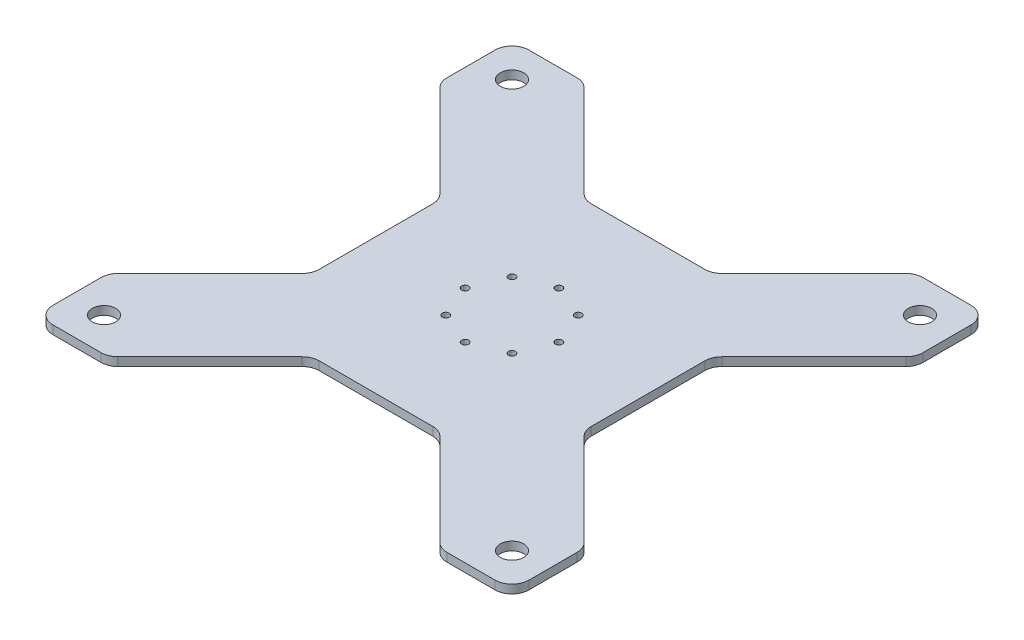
ISO-10303-21;
HEADER;
FILE_DESCRIPTION(('STEP AP214'),'2;1');
FILE_NAME('part.step','',(''),(''),'','','');
FILE_SCHEMA(('AUTOMOTIVE_DESIGN { 1 0 10303 214 1 1 1 1 }'));
ENDSEC;
DATA;
#1=APPLICATION_CONTEXT('core data for automotive mechanical design processes');
#2=APPLICATION_PROTOCOL_DEFINITION('international standard','automotive_design',2000,#1);
#3=PRODUCT_CONTEXT('',#1,'mechanical');
#4=PRODUCT('Part','Part','',(#3));
#5=PRODUCT_RELATED_PRODUCT_CATEGORY('part','',(#4));
#6=PRODUCT_DEFINITION_FORMATION('','',#4);
#7=PRODUCT_DEFINITION_CONTEXT('part definition',#1,'design');
#8=PRODUCT_DEFINITION('design','',#6,#7);
#9=PRODUCT_DEFINITION_SHAPE('','',#8);
#10=(LENGTH_UNIT() NAMED_UNIT(*) SI_UNIT(.MILLI.,.METRE.));
#11=(NAMED_UNIT(*) PLANE_ANGLE_UNIT() SI_UNIT($,.RADIAN.));
#12=(NAMED_UNIT(*) SI_UNIT($,.STERADIAN.) SOLID_ANGLE_UNIT());
#13=UNCERTAINTY_MEASURE_WITH_UNIT(LENGTH_MEASURE(1.E-05),#10,'distance_accuracy_value','');
#14=(GEOMETRIC_REPRESENTATION_CONTEXT(3) GLOBAL_UNCERTAINTY_ASSIGNED_CONTEXT((#13)) GLOBAL_UNIT_ASSIGNED_CONTEXT((#10,
#11,#12)) REPRESENTATION_CONTEXT('',''));
#15=CARTESIAN_POINT('',(0.,0.,0.));
#16=DIRECTION('',(0.,0.,1.));
#17=DIRECTION('',(1.,0.,0.));
#18=AXIS2_PLACEMENT_3D('',#15,#16,#17);
#19=CARTESIAN_POINT('',(-53.8815367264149,12.7,53.8815367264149));
#20=DIRECTION('',(0.707106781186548,0.,-0.707106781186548));
#21=DIRECTION('',(-0.707106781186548,0.,-0.707106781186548));
#22=AXIS2_PLACEMENT_3D('',#19,#20,#21);
#23=PLANE('',#22);
#24=DIRECTION('',(0.707106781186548,0.,0.707106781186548));
#25=VECTOR('',#24,1.);
#26=CARTESIAN_POINT('',(-53.8815367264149,0.,53.8815367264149));
#27=LINE('',#26,#25);
#28=CARTESIAN_POINT('',(-348.160512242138,0.,-240.397438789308));
#29=VERTEX_POINT('',#28);
#30=CARTESIAN_POINT('',(-210.639487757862,0.,-102.876414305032));
#31=VERTEX_POINT('',#30);
#32=EDGE_CURVE('E155',#29,#31,#27,.T.);
#33=ORIENTED_EDGE('',*,*,#32,.T.);
#34=DIRECTION('',(0.,-1.,0.));
#35=VECTOR('',#34,1.);
#36=CARTESIAN_POINT('',(-210.639487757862,12.7,-102.876414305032));
#37=LINE('',#36,#35);
#38=CARTESIAN_POINT('',(-210.639487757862,12.7,-102.876414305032));
#39=VERTEX_POINT('',#38);
#40=EDGE_CURVE('E11',#39,#31,#37,.T.);
#41=ORIENTED_EDGE('',*,*,#40,.F.);
#42=DIRECTION('',(0.707106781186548,0.,0.707106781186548));
#43=VECTOR('',#42,1.);
#44=CARTESIAN_POINT('',(-53.8815367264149,12.7,53.8815367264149));
#45=LINE('',#44,#43);
#46=CARTESIAN_POINT('',(-348.160512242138,12.7,-240.397438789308));
#47=VERTEX_POINT('',#46);
#48=EDGE_CURVE('E479',#47,#39,#45,.T.);
#49=ORIENTED_EDGE('',*,*,#48,.F.);
#50=DIRECTION('',(0.,-1.,0.));
#51=VECTOR('',#50,1.);
#52=CARTESIAN_POINT('',(-348.160512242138,12.7,-240.397438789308));
#53=LINE('',#52,#51);
#54=EDGE_CURVE('E144',#47,#29,#53,.T.);
#55=ORIENTED_EDGE('',*,*,#54,.T.);
#56=EDGE_LOOP('',(#33,#41,#49,#55));
#57=FACE_BOUND('',#56,.T.);
#58=ADVANCED_FACE('F34',(#57),#23,.F.);
#59=CARTESIAN_POINT('',(-228.6,12.7,-84.9159020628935));
#60=DIRECTION('',(0.,-1.,0.));
#61=DIRECTION('',(0.,0.,-1.));
#62=AXIS2_PLACEMENT_3D('',#59,#60,#61);
#63=CYLINDRICAL_SURFACE('',#62,25.4);
#64=CARTESIAN_POINT('',(-228.6,0.,-84.9159020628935));
#65=DIRECTION('',(0.,1.,0.));
#66=DIRECTION('',(0.,0.,1.));
#67=AXIS2_PLACEMENT_3D('',#64,#65,#66);
#68=CIRCLE('',#67,25.4);
#69=CARTESIAN_POINT('',(-203.2,0.,-84.9159020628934));
#70=VERTEX_POINT('',#69);
#71=EDGE_CURVE('E158',#31,#70,#68,.F.);
#72=ORIENTED_EDGE('',*,*,#71,.T.);
#73=DIRECTION('',(0.,-1.,0.));
#74=VECTOR('',#73,1.);
#75=CARTESIAN_POINT('',(-203.2,12.7,-84.9159020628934));
#76=LINE('',#75,#74);
#77=CARTESIAN_POINT('',(-203.2,12.7,-84.9159020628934));
#78=VERTEX_POINT('',#77);
#79=EDGE_CURVE('E43',#78,#70,#76,.T.);
#80=ORIENTED_EDGE('',*,*,#79,.F.);
#81=CARTESIAN_POINT('',(-228.6,12.7,-84.9159020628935));
#82=DIRECTION('',(0.,1.,0.));
#83=DIRECTION('',(0.,0.,1.));
#84=AXIS2_PLACEMENT_3D('',#81,#82,#83);
#85=CIRCLE('',#84,25.4);
#86=EDGE_CURVE('E101',#39,#78,#85,.F.);
#87=ORIENTED_EDGE('',*,*,#86,.F.);
#88=ORIENTED_EDGE('',*,*,#40,.T.);
#89=EDGE_LOOP('',(#72,#80,#87,#88));
#90=FACE_BOUND('',#89,.T.);
#91=ADVANCED_FACE('F515',(#90),#63,.F.);
#92=CARTESIAN_POINT('',(-203.2,12.7,0.));
#93=DIRECTION('',(1.,0.,0.));
#94=DIRECTION('',(0.,0.,-1.));
#95=AXIS2_PLACEMENT_3D('',#92,#93,#94);
#96=PLANE('',#95);
#97=DIRECTION('',(0.,0.,1.));
#98=VECTOR('',#97,1.);
#99=CARTESIAN_POINT('',(-203.2,0.,0.));
#100=LINE('',#99,#98);
#101=CARTESIAN_POINT('',(-203.200000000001,0.,84.9159020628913));
#102=VERTEX_POINT('',#101);
#103=EDGE_CURVE('E160',#70,#102,#100,.T.);
#104=ORIENTED_EDGE('',*,*,#103,.T.);
#105=DIRECTION('',(0.,-1.,0.));
#106=VECTOR('',#105,1.);
#107=CARTESIAN_POINT('',(-203.200000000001,12.7,84.9159020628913));
#108=LINE('',#107,#106);
#109=CARTESIAN_POINT('',(-203.200000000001,12.7,84.9159020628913));
#110=VERTEX_POINT('',#109);
#111=EDGE_CURVE('E263',#110,#102,#108,.T.);
#112=ORIENTED_EDGE('',*,*,#111,.F.);
#113=DIRECTION('',(0.,0.,1.));
#114=VECTOR('',#113,1.);
#115=CARTESIAN_POINT('',(-203.2,12.7,0.));
#116=LINE('',#115,#114);
#117=EDGE_CURVE('E201',#78,#110,#116,.T.);
#118=ORIENTED_EDGE('',*,*,#117,.F.);
#119=ORIENTED_EDGE('',*,*,#79,.T.);
#120=EDGE_LOOP('',(#104,#112,#118,#119));
#121=FACE_BOUND('',#120,.T.);
#122=ADVANCED_FACE('F196',(#121),#96,.F.);
#123=CARTESIAN_POINT('',(0.,12.7,-203.2));
#124=DIRECTION('',(0.,0.,-1.));
#125=DIRECTION('',(-1.,0.,0.));
#126=AXIS2_PLACEMENT_3D('',#123,#124,#125);
#127=PLANE('',#126);
#128=DIRECTION('',(1.,0.,0.));
#129=VECTOR('',#128,1.);
#130=CARTESIAN_POINT('',(0.,0.,-203.2));
#131=LINE('',#130,#129);
#132=CARTESIAN_POINT('',(-84.9159020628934,0.,-203.2));
#133=VERTEX_POINT('',#132);
#134=CARTESIAN_POINT('',(84.9159020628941,0.,-203.2));
#135=VERTEX_POINT('',#134);
#136=EDGE_CURVE('E163',#133,#135,#131,.T.);
#137=ORIENTED_EDGE('',*,*,#136,.F.);
#138=DIRECTION('',(0.,-1.,0.));
#139=VECTOR('',#138,1.);
#140=CARTESIAN_POINT('',(-84.9159020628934,12.7,-203.2));
#141=LINE('',#140,#139);
#142=CARTESIAN_POINT('',(-84.9159020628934,12.7,-203.2));
#143=VERTEX_POINT('',#142);
#144=EDGE_CURVE('E191',#143,#133,#141,.T.);
#145=ORIENTED_EDGE('',*,*,#144,.F.);
#146=DIRECTION('',(1.,0.,0.));
#147=VECTOR('',#146,1.);
#148=CARTESIAN_POINT('',(0.,12.7,-203.2));
#149=LINE('',#148,#147);
#150=CARTESIAN_POINT('',(84.9159020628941,12.7,-203.2));
#151=VERTEX_POINT('',#150);
#152=EDGE_CURVE('E483',#143,#151,#149,.T.);
#153=ORIENTED_EDGE('',*,*,#152,.T.);
#154=DIRECTION('',(0.,-1.,0.));
#155=VECTOR('',#154,1.);
#156=CARTESIAN_POINT('',(84.9159020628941,12.7,-203.2));
#157=LINE('',#156,#155);
#158=EDGE_CURVE('E469',#151,#135,#157,.T.);
#159=ORIENTED_EDGE('',*,*,#158,.T.);
#160=EDGE_LOOP('',(#137,#145,#153,#159));
#161=FACE_BOUND('',#160,.T.);
#162=ADVANCED_FACE('F979',(#161),#127,.T.);
#163=CARTESIAN_POINT('',(-84.9159020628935,12.7,-228.6));
#164=DIRECTION('',(0.,-1.,0.));
#165=DIRECTION('',(0.,0.,-1.));
#166=AXIS2_PLACEMENT_3D('',#163,#164,#165);
#167=CYLINDRICAL_SURFACE('',#166,25.4);
#168=CARTESIAN_POINT('',(-84.9159020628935,0.,-228.6));
#169=DIRECTION('',(0.,1.,0.));
#170=DIRECTION('',(0.,0.,1.));
#171=AXIS2_PLACEMENT_3D('',#168,#169,#170);
#172=CIRCLE('',#171,25.4);
#173=CARTESIAN_POINT('',(-102.876414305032,0.,-210.639487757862));
#174=VERTEX_POINT('',#173);
#175=EDGE_CURVE('E166',#174,#133,#172,.T.);
#176=ORIENTED_EDGE('',*,*,#175,.F.);
#177=DIRECTION('',(0.,-1.,0.));
#178=VECTOR('',#177,1.);
#179=CARTESIAN_POINT('',(-102.876414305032,12.7,-210.639487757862));
#180=LINE('',#179,#178);
#181=CARTESIAN_POINT('',(-102.876414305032,12.7,-210.639487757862));
#182=VERTEX_POINT('',#181);
#183=EDGE_CURVE('E189',#182,#174,#180,.T.);
#184=ORIENTED_EDGE('',*,*,#183,.F.);
#185=CARTESIAN_POINT('',(-84.9159020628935,12.7,-228.6));
#186=DIRECTION('',(0.,1.,0.));
#187=DIRECTION('',(0.,0.,1.));
#188=AXIS2_PLACEMENT_3D('',#185,#186,#187);
#189=CIRCLE('',#188,25.4);
#190=EDGE_CURVE('E486',#182,#143,#189,.T.);
#191=ORIENTED_EDGE('',*,*,#190,.T.);
#192=ORIENTED_EDGE('',*,*,#144,.T.);
#193=EDGE_LOOP('',(#176,#184,#191,#192));
#194=FACE_BOUND('',#193,.T.);
#195=ADVANCED_FACE('F961',(#194),#167,.F.);
#196=CARTESIAN_POINT('',(53.8815367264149,12.7,-53.8815367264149));
#197=DIRECTION('',(0.707106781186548,0.,-0.707106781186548));
#198=DIRECTION('',(-0.707106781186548,0.,-0.707106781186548));
#199=AXIS2_PLACEMENT_3D('',#196,#197,#198);
#200=PLANE('',#199);
#201=DIRECTION('',(0.707106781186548,0.,0.707106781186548));
#202=VECTOR('',#201,1.);
#203=CARTESIAN_POINT('',(53.8815367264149,0.,-53.8815367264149));
#204=LINE('',#203,#202);
#205=CARTESIAN_POINT('',(-240.397438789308,0.,-348.160512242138));
#206=VERTEX_POINT('',#205);
#207=EDGE_CURVE('E169',#206,#174,#204,.T.);
#208=ORIENTED_EDGE('',*,*,#207,.F.);
#209=DIRECTION('',(0.,-1.,0.));
#210=VECTOR('',#209,1.);
#211=CARTESIAN_POINT('',(-240.397438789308,12.7,-348.160512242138));
#212=LINE('',#211,#210);
#213=CARTESIAN_POINT('',(-240.397438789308,12.7,-348.160512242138));
#214=VERTEX_POINT('',#213);
#215=EDGE_CURVE('E187',#214,#206,#212,.T.);
#216=ORIENTED_EDGE('',*,*,#215,.F.);
#217=DIRECTION('',(0.707106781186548,0.,0.707106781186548));
#218=VECTOR('',#217,1.);
#219=CARTESIAN_POINT('',(53.8815367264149,12.7,-53.8815367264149));
#220=LINE('',#219,#218);
#221=EDGE_CURVE('E489',#214,#182,#220,.T.);
#222=ORIENTED_EDGE('',*,*,#221,.T.);
#223=ORIENTED_EDGE('',*,*,#183,.T.);
#224=EDGE_LOOP('',(#208,#216,#222,#223));
#225=FACE_BOUND('',#224,.T.);
#226=ADVANCED_FACE('F964',(#225),#200,.T.);
#227=CARTESIAN_POINT('',(-258.357951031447,12.7,-330.2));
#228=DIRECTION('',(0.,-1.,0.));
#229=DIRECTION('',(0.,0.,-1.));
#230=AXIS2_PLACEMENT_3D('',#227,#228,#229);
#231=CYLINDRICAL_SURFACE('',#230,25.4);
#232=CARTESIAN_POINT('',(-258.357951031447,0.,-330.2));
#233=DIRECTION('',(0.,1.,0.));
#234=DIRECTION('',(0.,0.,1.));
#235=AXIS2_PLACEMENT_3D('',#232,#233,#234);
#236=CIRCLE('',#235,25.4);
#237=CARTESIAN_POINT('',(-258.357951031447,0.,-355.6));
#238=VERTEX_POINT('',#237);
#239=EDGE_CURVE('E172',#238,#206,#236,.F.);
#240=ORIENTED_EDGE('',*,*,#239,.F.);
#241=DIRECTION('',(0.,-1.,0.));
#242=VECTOR('',#241,1.);
#243=CARTESIAN_POINT('',(-258.357951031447,12.7,-355.6));
#244=LINE('',#243,#242);
#245=CARTESIAN_POINT('',(-258.357951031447,12.7,-355.6));
#246=VERTEX_POINT('',#245);
#247=EDGE_CURVE('E185',#246,#238,#244,.T.);
#248=ORIENTED_EDGE('',*,*,#247,.F.);
#249=CARTESIAN_POINT('',(-258.357951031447,12.7,-330.2));
#250=DIRECTION('',(0.,1.,0.));
#251=DIRECTION('',(0.,0.,1.));
#252=AXIS2_PLACEMENT_3D('',#249,#250,#251);
#253=CIRCLE('',#252,25.4);
#254=EDGE_CURVE('E492',#246,#214,#253,.F.);
#255=ORIENTED_EDGE('',*,*,#254,.T.);
#256=ORIENTED_EDGE('',*,*,#215,.T.);
#257=EDGE_LOOP('',(#240,#248,#255,#256));
#258=FACE_BOUND('',#257,.T.);
#259=ADVANCED_FACE('F966',(#258),#231,.T.);
#260=CARTESIAN_POINT('',(-2.74766180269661E-13,12.7,-355.6));
#261=DIRECTION('',(0.,0.,-1.));
#262=DIRECTION('',(-1.,0.,0.));
#263=AXIS2_PLACEMENT_3D('',#260,#261,#262);
#264=PLANE('',#263);
#265=DIRECTION('',(1.,0.,0.));
#266=VECTOR('',#265,1.);
#267=CARTESIAN_POINT('',(-2.74766180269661E-13,0.,-355.6));
#268=LINE('',#267,#266);
#269=CARTESIAN_POINT('',(-330.2,0.,-355.6));
#270=VERTEX_POINT('',#269);
#271=EDGE_CURVE('E175',#270,#238,#268,.T.);
#272=ORIENTED_EDGE('',*,*,#271,.F.);
#273=DIRECTION('',(0.,-1.,0.));
#274=VECTOR('',#273,1.);
#275=CARTESIAN_POINT('',(-330.2,12.7,-355.6));
#276=LINE('',#275,#274);
#277=CARTESIAN_POINT('',(-330.2,12.7,-355.6));
#278=VERTEX_POINT('',#277);
#279=EDGE_CURVE('E139',#278,#270,#276,.T.);
#280=ORIENTED_EDGE('',*,*,#279,.F.);
#281=DIRECTION('',(1.,0.,0.));
#282=VECTOR('',#281,1.);
#283=CARTESIAN_POINT('',(-2.74766180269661E-13,12.7,-355.6));
#284=LINE('',#283,#282);
#285=EDGE_CURVE('E132',#278,#246,#284,.T.);
#286=ORIENTED_EDGE('',*,*,#285,.T.);
#287=ORIENTED_EDGE('',*,*,#247,.T.);
#288=EDGE_LOOP('',(#272,#280,#286,#287));
#289=FACE_BOUND('',#288,.T.);
#290=ADVANCED_FACE('F496',(#289),#264,.T.);
#291=CARTESIAN_POINT('',(-330.2,12.7,-330.2));
#292=DIRECTION('',(0.,-1.,0.));
#293=DIRECTION('',(0.,0.,-1.));
#294=AXIS2_PLACEMENT_3D('',#291,#292,#293);
#295=CYLINDRICAL_SURFACE('',#294,25.4);
#296=CARTESIAN_POINT('',(-330.2,0.,-330.2));
#297=DIRECTION('',(0.,1.,0.));
#298=DIRECTION('',(0.,0.,1.));
#299=AXIS2_PLACEMENT_3D('',#296,#297,#298);
#300=CIRCLE('',#299,25.4);
#301=CARTESIAN_POINT('',(-355.6,0.,-330.2));
#302=VERTEX_POINT('',#301);
#303=EDGE_CURVE('E138',#270,#302,#300,.T.);
#304=ORIENTED_EDGE('',*,*,#303,.T.);
#305=DIRECTION('',(0.,-1.,0.));
#306=VECTOR('',#305,1.);
#307=CARTESIAN_POINT('',(-355.6,12.7,-330.2));
#308=LINE('',#307,#306);
#309=CARTESIAN_POINT('',(-355.6,12.7,-330.2));
#310=VERTEX_POINT('',#309);
#311=EDGE_CURVE('E135',#310,#302,#308,.T.);
#312=ORIENTED_EDGE('',*,*,#311,.F.);
#313=CARTESIAN_POINT('',(-330.2,12.7,-330.2));
#314=DIRECTION('',(0.,1.,0.));
#315=DIRECTION('',(0.,0.,1.));
#316=AXIS2_PLACEMENT_3D('',#313,#314,#315);
#317=CIRCLE('',#316,25.4);
#318=EDGE_CURVE('E124',#278,#310,#317,.T.);
#319=ORIENTED_EDGE('',*,*,#318,.F.);
#320=ORIENTED_EDGE('',*,*,#279,.T.);
#321=EDGE_LOOP('',(#304,#312,#319,#320));
#322=FACE_BOUND('',#321,.T.);
#323=ADVANCED_FACE('F136',(#322),#295,.T.);
#324=CARTESIAN_POINT('',(-355.6,12.7,5.49532360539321E-13));
#325=DIRECTION('',(1.,0.,0.));
#326=DIRECTION('',(0.,0.,-1.));
#327=AXIS2_PLACEMENT_3D('',#324,#325,#326);
#328=PLANE('',#327);
#329=DIRECTION('',(0.,0.,1.));
#330=VECTOR('',#329,1.);
#331=CARTESIAN_POINT('',(-355.6,0.,5.49532360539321E-13));
#332=LINE('',#331,#330);
#333=CARTESIAN_POINT('',(-355.6,0.,-258.357951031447));
#334=VERTEX_POINT('',#333);
#335=EDGE_CURVE('E87',#302,#334,#332,.T.);
#336=ORIENTED_EDGE('',*,*,#335,.T.);
#337=DIRECTION('',(0.,-1.,0.));
#338=VECTOR('',#337,1.);
#339=CARTESIAN_POINT('',(-355.6,12.7,-258.357951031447));
#340=LINE('',#339,#338);
#341=CARTESIAN_POINT('',(-355.6,12.7,-258.357951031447));
#342=VERTEX_POINT('',#341);
#343=EDGE_CURVE('E140',#342,#334,#340,.T.);
#344=ORIENTED_EDGE('',*,*,#343,.F.);
#345=DIRECTION('',(0.,0.,1.));
#346=VECTOR('',#345,1.);
#347=CARTESIAN_POINT('',(-355.6,12.7,5.49532360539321E-13));
#348=LINE('',#347,#346);
#349=EDGE_CURVE('E129',#310,#342,#348,.T.);
#350=ORIENTED_EDGE('',*,*,#349,.F.);
#351=ORIENTED_EDGE('',*,*,#311,.T.);
#352=EDGE_LOOP('',(#336,#344,#350,#351));
#353=FACE_BOUND('',#352,.T.);
#354=ADVANCED_FACE('F142',(#353),#328,.F.);
#355=CARTESIAN_POINT('',(-304.8,12.7,-304.8));
#356=DIRECTION('',(0.,-1.,0.));
#357=DIRECTION('',(0.,0.,-1.));
#358=AXIS2_PLACEMENT_3D('',#355,#356,#357);
#359=CYLINDRICAL_SURFACE('',#358,17.5);
#360=CARTESIAN_POINT('',(-304.8,12.7,-304.8));
#361=DIRECTION('',(0.,1.,0.));
#362=DIRECTION('',(0.,0.,1.));
#363=AXIS2_PLACEMENT_3D('',#360,#361,#362);
#364=CIRCLE('',#363,17.5);
#365=CARTESIAN_POINT('',(-304.8,12.7,-287.3));
#366=VERTEX_POINT('',#365);
#367=EDGE_CURVE('E476',#366,#366,#364,.T.);
#368=ORIENTED_EDGE('',*,*,#367,.T.);
#369=EDGE_LOOP('',(#368));
#370=FACE_BOUND('',#369,.T.);
#371=CARTESIAN_POINT('',(-304.8,0.,-304.8));
#372=DIRECTION('',(0.,1.,0.));
#373=DIRECTION('',(0.,0.,1.));
#374=AXIS2_PLACEMENT_3D('',#371,#372,#373);
#375=CIRCLE('',#374,17.5);
#376=CARTESIAN_POINT('',(-304.8,0.,-287.3));
#377=VERTEX_POINT('',#376);
#378=EDGE_CURVE('E151',#377,#377,#375,.T.);
#379=ORIENTED_EDGE('',*,*,#378,.F.);
#380=EDGE_LOOP('',(#379));
#381=FACE_BOUND('',#380,.T.);
#382=ADVANCED_FACE('F510',(#370,#381),#359,.F.);
#383=CARTESIAN_POINT('',(-49.4974746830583,12.7,-49.4974746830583));
#384=DIRECTION('',(0.,-1.,0.));
#385=DIRECTION('',(0.,0.,-1.));
#386=AXIS2_PLACEMENT_3D('',#383,#384,#385);
#387=CYLINDRICAL_SURFACE('',#386,5.25);
#388=CARTESIAN_POINT('',(-49.4974746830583,12.7,-49.4974746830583));
#389=DIRECTION('',(0.,1.,0.));
#390=DIRECTION('',(0.,0.,1.));
#391=AXIS2_PLACEMENT_3D('',#388,#389,#390);
#392=CIRCLE('',#391,5.25);
#393=CARTESIAN_POINT('',(-49.4974746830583,12.7,-44.2474746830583));
#394=VERTEX_POINT('',#393);
#395=EDGE_CURVE('E181',#394,#394,#392,.T.);
#396=ORIENTED_EDGE('',*,*,#395,.T.);
#397=EDGE_LOOP('',(#396));
#398=FACE_BOUND('',#397,.T.);
#399=CARTESIAN_POINT('',(-49.4974746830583,0.,-49.4974746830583));
#400=DIRECTION('',(0.,1.,0.));
#401=DIRECTION('',(0.,0.,1.));
#402=AXIS2_PLACEMENT_3D('',#399,#400,#401);
#403=CIRCLE('',#402,5.25);
#404=CARTESIAN_POINT('',(-49.4974746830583,0.,-44.2474746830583));
#405=VERTEX_POINT('',#404);
#406=EDGE_CURVE('E148',#405,#405,#403,.T.);
#407=ORIENTED_EDGE('',*,*,#406,.F.);
#408=EDGE_LOOP('',(#407));
#409=FACE_BOUND('',#408,.T.);
#410=ADVANCED_FACE('F36',(#398,#409),#387,.F.);
#411=CARTESIAN_POINT('',(-330.2,12.7,-258.357951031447));
#412=DIRECTION('',(0.,-1.,0.));
#413=DIRECTION('',(0.,0.,-1.));
#414=AXIS2_PLACEMENT_3D('',#411,#412,#413);
#415=CYLINDRICAL_SURFACE('',#414,25.4);
#416=CARTESIAN_POINT('',(-330.2,0.,-258.357951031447));
#417=DIRECTION('',(0.,1.,0.));
#418=DIRECTION('',(0.,0.,1.));
#419=AXIS2_PLACEMENT_3D('',#416,#417,#418);
#420=CIRCLE('',#419,25.4);
#421=EDGE_CURVE('E93',#334,#29,#420,.T.);
#422=ORIENTED_EDGE('',*,*,#421,.T.);
#423=ORIENTED_EDGE('',*,*,#54,.F.);
#424=CARTESIAN_POINT('',(-330.2,12.7,-258.357951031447));
#425=DIRECTION('',(0.,1.,0.));
#426=DIRECTION('',(0.,0.,1.));
#427=AXIS2_PLACEMENT_3D('',#424,#425,#426);
#428=CIRCLE('',#427,25.4);
#429=EDGE_CURVE('E51',#342,#47,#428,.T.);
#430=ORIENTED_EDGE('',*,*,#429,.F.);
#431=ORIENTED_EDGE('',*,*,#343,.T.);
#432=EDGE_LOOP('',(#422,#423,#430,#431));
#433=FACE_BOUND('',#432,.T.);
#434=ADVANCED_FACE('F501',(#433),#415,.T.);
#435=CARTESIAN_POINT('',(0.,12.7,0.));
#436=DIRECTION('',(0.,1.,0.));
#437=DIRECTION('',(0.,0.,1.));
#438=AXIS2_PLACEMENT_3D('',#435,#436,#437);
#439=PLANE('',#438);
#440=CARTESIAN_POINT('',(-69.999999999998,12.7,1.98951966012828E-12));
#441=DIRECTION('',(0.,1.,0.));
#442=DIRECTION('',(0.,0.,1.));
#443=AXIS2_PLACEMENT_3D('',#440,#441,#442);
#444=CIRCLE('',#443,5.25000000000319);
#445=CARTESIAN_POINT('',(-69.999999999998,12.7,5.25000000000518));
#446=VERTEX_POINT('',#445);
#447=EDGE_CURVE('E697',#446,#446,#444,.T.);
#448=ORIENTED_EDGE('',*,*,#447,.F.);
#449=EDGE_LOOP('',(#448));
#450=FACE_BOUND('',#449,.T.);
#451=CARTESIAN_POINT('',(3.9618942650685E-12,12.7,70.));
#452=DIRECTION('',(0.,1.,0.));
#453=DIRECTION('',(0.,0.,1.));
#454=AXIS2_PLACEMENT_3D('',#451,#452,#453);
#455=CIRCLE('',#454,5.25000000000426);
#456=CARTESIAN_POINT('',(3.9618942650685E-12,12.7,75.2500000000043));
#457=VERTEX_POINT('',#456);
#458=EDGE_CURVE('E700',#457,#457,#455,.T.);
#459=ORIENTED_EDGE('',*,*,#458,.F.);
#460=EDGE_LOOP('',(#459));
#461=FACE_BOUND('',#460,.T.);
#462=CARTESIAN_POINT('',(70.000000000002,12.7,-1.98094713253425E-12));
#463=DIRECTION('',(0.,1.,0.));
#464=DIRECTION('',(0.,0.,1.));
#465=AXIS2_PLACEMENT_3D('',#462,#463,#464);
#466=CIRCLE('',#465,5.25000000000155);
#467=CARTESIAN_POINT('',(70.000000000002,12.7,5.24999999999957));
#468=VERTEX_POINT('',#467);
#469=EDGE_CURVE('E709',#468,#468,#466,.T.);
#470=ORIENTED_EDGE('',*,*,#469,.F.);
#471=EDGE_LOOP('',(#470));
#472=FACE_BOUND('',#471,.T.);
#473=CARTESIAN_POINT('',(0.,12.7,-70.));
#474=DIRECTION('',(0.,1.,0.));
#475=DIRECTION('',(0.,0.,1.));
#476=AXIS2_PLACEMENT_3D('',#473,#474,#475);
#477=CIRCLE('',#476,5.25000000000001);
#478=CARTESIAN_POINT('',(0.,12.7,-64.75));
#479=VERTEX_POINT('',#478);
#480=EDGE_CURVE('E715',#479,#479,#477,.T.);
#481=ORIENTED_EDGE('',*,*,#480,.F.);
#482=EDGE_LOOP('',(#481));
#483=FACE_BOUND('',#482,.T.);
#484=ORIENTED_EDGE('',*,*,#395,.F.);
#485=EDGE_LOOP('',(#484));
#486=FACE_BOUND('',#485,.T.);
#487=ORIENTED_EDGE('',*,*,#367,.F.);
#488=EDGE_LOOP('',(#487));
#489=FACE_BOUND('',#488,.T.);
#490=ORIENTED_EDGE('',*,*,#48,.T.);
#491=ORIENTED_EDGE('',*,*,#86,.T.);
#492=ORIENTED_EDGE('',*,*,#117,.T.);
#493=CARTESIAN_POINT('',(-228.600000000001,12.7,84.9159020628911));
#494=DIRECTION('',(0.,1.,0.));
#495=DIRECTION('',(1.,0.,0.));
#496=AXIS2_PLACEMENT_3D('',#493,#494,#495);
#497=CIRCLE('',#496,25.4);
#498=CARTESIAN_POINT('',(-210.639487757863,12.7,102.87641430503));
#499=VERTEX_POINT('',#498);
#500=EDGE_CURVE('E733',#499,#110,#497,.T.);
#501=ORIENTED_EDGE('',*,*,#500,.F.);
#502=DIRECTION('',(0.707106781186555,0.,-0.70710678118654));
#503=VECTOR('',#502,1.);
#504=CARTESIAN_POINT('',(-53.8815367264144,12.7,-53.8815367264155));
#505=LINE('',#504,#503);
#506=CARTESIAN_POINT('',(-348.160512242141,12.7,240.397438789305));
#507=VERTEX_POINT('',#506);
#508=EDGE_CURVE('E736',#507,#499,#505,.T.);
#509=ORIENTED_EDGE('',*,*,#508,.F.);
#510=CARTESIAN_POINT('',(-330.200000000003,12.7,258.357951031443));
#511=DIRECTION('',(0.,1.,0.));
#512=DIRECTION('',(1.,0.,0.));
#513=AXIS2_PLACEMENT_3D('',#510,#511,#512);
#514=CIRCLE('',#513,25.4);
#515=CARTESIAN_POINT('',(-355.600000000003,12.7,258.357951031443));
#516=VERTEX_POINT('',#515);
#517=EDGE_CURVE('E739',#516,#507,#514,.F.);
#518=ORIENTED_EDGE('',*,*,#517,.F.);
#519=DIRECTION('',(0.,0.,-1.));
#520=VECTOR('',#519,1.);
#521=CARTESIAN_POINT('',(-355.6,12.7,-3.4499461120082E-12));
#522=LINE('',#521,#520);
#523=CARTESIAN_POINT('',(-355.600000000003,12.7,330.199999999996));
#524=VERTEX_POINT('',#523);
#525=EDGE_CURVE('E742',#524,#516,#522,.T.);
#526=ORIENTED_EDGE('',*,*,#525,.F.);
#527=CARTESIAN_POINT('',(-330.200000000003,12.7,330.199999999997));
#528=DIRECTION('',(0.,1.,0.));
#529=DIRECTION('',(1.,0.,0.));
#530=AXIS2_PLACEMENT_3D('',#527,#528,#529);
#531=CIRCLE('',#530,25.4);
#532=CARTESIAN_POINT('',(-330.200000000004,12.7,355.599999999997));
#533=VERTEX_POINT('',#532);
#534=EDGE_CURVE('E745',#524,#533,#531,.T.);
#535=ORIENTED_EDGE('',*,*,#534,.T.);
#536=DIRECTION('',(1.,0.,0.));
#537=VECTOR('',#536,1.);
#538=CARTESIAN_POINT('',(-3.17517993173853E-12,12.7,355.6));
#539=LINE('',#538,#537);
#540=CARTESIAN_POINT('',(-258.357951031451,12.7,355.599999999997));
#541=VERTEX_POINT('',#540);
#542=EDGE_CURVE('E748',#533,#541,#539,.T.);
#543=ORIENTED_EDGE('',*,*,#542,.T.);
#544=CARTESIAN_POINT('',(-258.35795103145,12.7,330.199999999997));
#545=DIRECTION('',(0.,1.,0.));
#546=DIRECTION('',(1.,0.,0.));
#547=AXIS2_PLACEMENT_3D('',#544,#545,#546);
#548=CIRCLE('',#547,25.4);
#549=CARTESIAN_POINT('',(-240.397438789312,12.7,348.160512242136));
#550=VERTEX_POINT('',#549);
#551=EDGE_CURVE('E245',#541,#550,#548,.T.);
#552=ORIENTED_EDGE('',*,*,#551,.T.);
#553=DIRECTION('',(0.707106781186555,0.,-0.70710678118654));
#554=VECTOR('',#553,1.);
#555=CARTESIAN_POINT('',(53.8815367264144,12.7,53.8815367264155));
#556=LINE('',#555,#554);
#557=CARTESIAN_POINT('',(-102.876414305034,12.7,210.639487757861));
#558=VERTEX_POINT('',#557);
#559=EDGE_CURVE('E727',#550,#558,#556,.T.);
#560=ORIENTED_EDGE('',*,*,#559,.T.);
#561=CARTESIAN_POINT('',(-84.9159020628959,12.7,228.599999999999));
#562=DIRECTION('',(0.,1.,0.));
#563=DIRECTION('',(1.,0.,0.));
#564=AXIS2_PLACEMENT_3D('',#561,#562,#563);
#565=CIRCLE('',#564,25.4);
#566=CARTESIAN_POINT('',(-84.9159020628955,12.7,203.199999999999));
#567=VERTEX_POINT('',#566);
#568=EDGE_CURVE('E730',#558,#567,#565,.F.);
#569=ORIENTED_EDGE('',*,*,#568,.T.);
#570=DIRECTION('',(-1.,0.,0.));
#571=VECTOR('',#570,1.);
#572=CARTESIAN_POINT('',(0.,12.7,203.2));
#573=LINE('',#572,#571);
#574=CARTESIAN_POINT('',(84.9159020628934,12.7,203.2));
#575=VERTEX_POINT('',#574);
#576=EDGE_CURVE('E285',#575,#567,#573,.T.);
#577=ORIENTED_EDGE('',*,*,#576,.F.);
#578=CARTESIAN_POINT('',(84.9159020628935,12.7,228.6));
#579=DIRECTION('',(0.,1.,0.));
#580=DIRECTION('',(0.,0.,-1.));
#581=AXIS2_PLACEMENT_3D('',#578,#579,#580);
#582=CIRCLE('',#581,25.4);
#583=CARTESIAN_POINT('',(102.876414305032,12.7,210.639487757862));
#584=VERTEX_POINT('',#583);
#585=EDGE_CURVE('E288',#584,#575,#582,.T.);
#586=ORIENTED_EDGE('',*,*,#585,.F.);
#587=DIRECTION('',(-0.707106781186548,0.,-0.707106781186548));
#588=VECTOR('',#587,1.);
#589=CARTESIAN_POINT('',(-53.8815367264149,12.7,53.8815367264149));
#590=LINE('',#589,#588);
#591=CARTESIAN_POINT('',(240.397438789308,12.7,348.160512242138));
#592=VERTEX_POINT('',#591);
#593=EDGE_CURVE('E291',#592,#584,#590,.T.);
#594=ORIENTED_EDGE('',*,*,#593,.F.);
#595=CARTESIAN_POINT('',(258.357951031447,12.7,330.2));
#596=DIRECTION('',(0.,1.,0.));
#597=DIRECTION('',(0.,0.,-1.));
#598=AXIS2_PLACEMENT_3D('',#595,#596,#597);
#599=CIRCLE('',#598,25.4);
#600=CARTESIAN_POINT('',(258.357951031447,12.7,355.6));
#601=VERTEX_POINT('',#600);
#602=EDGE_CURVE('E294',#601,#592,#599,.F.);
#603=ORIENTED_EDGE('',*,*,#602,.F.);
#604=DIRECTION('',(-1.,0.,0.));
#605=VECTOR('',#604,1.);
#606=CARTESIAN_POINT('',(2.74766180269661E-13,12.7,355.6));
#607=LINE('',#606,#605);
#608=CARTESIAN_POINT('',(330.2,12.7,355.6));
#609=VERTEX_POINT('',#608);
#610=EDGE_CURVE('E297',#609,#601,#607,.T.);
#611=ORIENTED_EDGE('',*,*,#610,.F.);
#612=CARTESIAN_POINT('',(330.2,12.7,330.2));
#613=DIRECTION('',(0.,1.,0.));
#614=DIRECTION('',(0.,0.,-1.));
#615=AXIS2_PLACEMENT_3D('',#612,#613,#614);
#616=CIRCLE('',#615,25.4);
#617=CARTESIAN_POINT('',(355.6,12.7,330.2));
#618=VERTEX_POINT('',#617);
#619=EDGE_CURVE('E300',#609,#618,#616,.T.);
#620=ORIENTED_EDGE('',*,*,#619,.T.);
#621=DIRECTION('',(0.,0.,-1.));
#622=VECTOR('',#621,1.);
#623=CARTESIAN_POINT('',(355.6,12.7,-5.49532360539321E-13));
#624=LINE('',#623,#622);
#625=CARTESIAN_POINT('',(355.6,12.7,258.357951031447));
#626=VERTEX_POINT('',#625);
#627=EDGE_CURVE('E303',#618,#626,#624,.T.);
#628=ORIENTED_EDGE('',*,*,#627,.T.);
#629=CARTESIAN_POINT('',(330.2,12.7,258.357951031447));
#630=DIRECTION('',(0.,1.,0.));
#631=DIRECTION('',(0.,0.,-1.));
#632=AXIS2_PLACEMENT_3D('',#629,#630,#631);
#633=CIRCLE('',#632,25.4);
#634=CARTESIAN_POINT('',(348.160512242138,12.7,240.397438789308));
#635=VERTEX_POINT('',#634);
#636=EDGE_CURVE('E306',#626,#635,#633,.T.);
#637=ORIENTED_EDGE('',*,*,#636,.T.);
#638=DIRECTION('',(-0.707106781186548,0.,-0.707106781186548));
#639=VECTOR('',#638,1.);
#640=CARTESIAN_POINT('',(53.8815367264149,12.7,-53.8815367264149));
#641=LINE('',#640,#639);
#642=CARTESIAN_POINT('',(210.639487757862,12.7,102.876414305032));
#643=VERTEX_POINT('',#642);
#644=EDGE_CURVE('E279',#635,#643,#641,.T.);
#645=ORIENTED_EDGE('',*,*,#644,.T.);
#646=CARTESIAN_POINT('',(228.6,12.7,84.9159020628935));
#647=DIRECTION('',(0.,1.,0.));
#648=DIRECTION('',(0.,0.,-1.));
#649=AXIS2_PLACEMENT_3D('',#646,#647,#648);
#650=CIRCLE('',#649,25.4);
#651=CARTESIAN_POINT('',(203.2,12.7,84.9159020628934));
#652=VERTEX_POINT('',#651);
#653=EDGE_CURVE('E282',#643,#652,#650,.F.);
#654=ORIENTED_EDGE('',*,*,#653,.T.);
#655=DIRECTION('',(0.,0.,1.));
#656=VECTOR('',#655,1.);
#657=CARTESIAN_POINT('',(203.2,12.7,7.09469008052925E-13));
#658=LINE('',#657,#656);
#659=CARTESIAN_POINT('',(203.2,12.7,-84.9159020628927));
#660=VERTEX_POINT('',#659);
#661=EDGE_CURVE('E387',#660,#652,#658,.T.);
#662=ORIENTED_EDGE('',*,*,#661,.F.);
#663=CARTESIAN_POINT('',(228.6,12.7,-84.9159020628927));
#664=DIRECTION('',(0.,1.,0.));
#665=DIRECTION('',(-1.,0.,0.));
#666=AXIS2_PLACEMENT_3D('',#663,#664,#665);
#667=CIRCLE('',#666,25.4);
#668=CARTESIAN_POINT('',(210.639487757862,12.7,-102.876414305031));
#669=VERTEX_POINT('',#668);
#670=EDGE_CURVE('E390',#669,#660,#667,.T.);
#671=ORIENTED_EDGE('',*,*,#670,.F.);
#672=DIRECTION('',(-0.70710678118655,0.,0.707106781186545));
#673=VECTOR('',#672,1.);
#674=CARTESIAN_POINT('',(53.8815367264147,12.7,53.8815367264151));
#675=LINE('',#674,#673);
#676=CARTESIAN_POINT('',(348.160512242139,12.7,-240.397438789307));
#677=VERTEX_POINT('',#676);
#678=EDGE_CURVE('E393',#677,#669,#675,.T.);
#679=ORIENTED_EDGE('',*,*,#678,.F.);
#680=CARTESIAN_POINT('',(330.200000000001,12.7,-258.357951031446));
#681=DIRECTION('',(0.,1.,0.));
#682=DIRECTION('',(-1.,0.,0.));
#683=AXIS2_PLACEMENT_3D('',#680,#681,#682);
#684=CIRCLE('',#683,25.4);
#685=CARTESIAN_POINT('',(355.600000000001,12.7,-258.357951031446));
#686=VERTEX_POINT('',#685);
#687=EDGE_CURVE('E396',#686,#677,#684,.F.);
#688=ORIENTED_EDGE('',*,*,#687,.F.);
#689=DIRECTION('',(0.,0.,1.));
#690=VECTOR('',#689,1.);
#691=CARTESIAN_POINT('',(355.6,12.7,9.66804583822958E-13));
#692=LINE('',#691,#690);
#693=CARTESIAN_POINT('',(355.600000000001,12.7,-330.199999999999));
#694=VERTEX_POINT('',#693);
#695=EDGE_CURVE('E399',#694,#686,#692,.T.);
#696=ORIENTED_EDGE('',*,*,#695,.F.);
#697=CARTESIAN_POINT('',(330.200000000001,12.7,-330.199999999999));
#698=DIRECTION('',(0.,1.,0.));
#699=DIRECTION('',(-1.,0.,0.));
#700=AXIS2_PLACEMENT_3D('',#697,#698,#699);
#701=CIRCLE('',#700,25.4);
#702=CARTESIAN_POINT('',(330.200000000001,12.7,-355.599999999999));
#703=VERTEX_POINT('',#702);
#704=EDGE_CURVE('E402',#694,#703,#701,.T.);
#705=ORIENTED_EDGE('',*,*,#704,.T.);
#706=DIRECTION('',(-1.,0.,0.));
#707=VECTOR('',#706,1.);
#708=CARTESIAN_POINT('',(6.92038403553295E-13,12.7,-355.6));
#709=LINE('',#708,#707);
#710=CARTESIAN_POINT('',(258.357951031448,12.7,-355.599999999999));
#711=VERTEX_POINT('',#710);
#712=EDGE_CURVE('E405',#703,#711,#709,.T.);
#713=ORIENTED_EDGE('',*,*,#712,.T.);
#714=CARTESIAN_POINT('',(258.357951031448,12.7,-330.199999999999));
#715=DIRECTION('',(0.,1.,0.));
#716=DIRECTION('',(-1.,0.,0.));
#717=AXIS2_PLACEMENT_3D('',#714,#715,#716);
#718=CIRCLE('',#717,25.4);
#719=CARTESIAN_POINT('',(240.39743878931,12.7,-348.160512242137));
#720=VERTEX_POINT('',#719);
#721=EDGE_CURVE('E408',#711,#720,#718,.T.);
#722=ORIENTED_EDGE('',*,*,#721,.T.);
#723=DIRECTION('',(-0.70710678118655,0.,0.707106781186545));
#724=VECTOR('',#723,1.);
#725=CARTESIAN_POINT('',(-53.8815367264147,12.7,-53.8815367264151));
#726=LINE('',#725,#724);
#727=CARTESIAN_POINT('',(102.876414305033,12.7,-210.639487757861));
#728=VERTEX_POINT('',#727);
#729=EDGE_CURVE('E381',#720,#728,#726,.T.);
#730=ORIENTED_EDGE('',*,*,#729,.T.);
#731=CARTESIAN_POINT('',(84.9159020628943,12.7,-228.6));
#732=DIRECTION('',(0.,1.,0.));
#733=DIRECTION('',(-1.,0.,0.));
#734=AXIS2_PLACEMENT_3D('',#731,#732,#733);
#735=CIRCLE('',#734,25.4);
#736=EDGE_CURVE('E384',#728,#151,#735,.F.);
#737=ORIENTED_EDGE('',*,*,#736,.T.);
#738=ORIENTED_EDGE('',*,*,#152,.F.);
#739=ORIENTED_EDGE('',*,*,#190,.F.);
#740=ORIENTED_EDGE('',*,*,#221,.F.);
#741=ORIENTED_EDGE('',*,*,#254,.F.);
#742=ORIENTED_EDGE('',*,*,#285,.F.);
#743=ORIENTED_EDGE('',*,*,#318,.T.);
#744=ORIENTED_EDGE('',*,*,#349,.T.);
#745=ORIENTED_EDGE('',*,*,#429,.T.);
#746=EDGE_LOOP('',(#490,#491,#492,#501,#509,#518,#526,#535,#543,#552,#560,#569,#577,#586,#594,
#603,#611,#620,#628,#637,#645,#654,#662,#671,#679,#688,#696,#705,#713,#722,#730,#737,#738,#739,
#740,#741,#742,#743,#744,#745));
#747=FACE_BOUND('',#746,.T.);
#748=CARTESIAN_POINT('',(49.4974746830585,12.7,-49.4974746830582));
#749=DIRECTION('',(0.,1.,0.));
#750=DIRECTION('',(-1.,0.,0.));
#751=AXIS2_PLACEMENT_3D('',#748,#749,#750);
#752=CIRCLE('',#751,5.25);
#753=CARTESIAN_POINT('',(44.2474746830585,12.7,-49.4974746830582));
#754=VERTEX_POINT('',#753);
#755=EDGE_CURVE('E374',#754,#754,#752,.T.);
#756=ORIENTED_EDGE('',*,*,#755,.F.);
#757=EDGE_LOOP('',(#756));
#758=FACE_BOUND('',#757,.T.);
#759=CARTESIAN_POINT('',(304.800000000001,12.7,-304.799999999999));
#760=DIRECTION('',(0.,1.,0.));
#761=DIRECTION('',(-1.,0.,0.));
#762=AXIS2_PLACEMENT_3D('',#759,#760,#761);
#763=CIRCLE('',#762,17.5);
#764=CARTESIAN_POINT('',(287.300000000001,12.7,-304.799999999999));
#765=VERTEX_POINT('',#764);
#766=EDGE_CURVE('E377',#765,#765,#763,.T.);
#767=ORIENTED_EDGE('',*,*,#766,.F.);
#768=EDGE_LOOP('',(#767));
#769=FACE_BOUND('',#768,.T.);
#770=CARTESIAN_POINT('',(49.4974746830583,12.7,49.4974746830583));
#771=DIRECTION('',(0.,1.,0.));
#772=DIRECTION('',(0.,0.,-1.));
#773=AXIS2_PLACEMENT_3D('',#770,#771,#772);
#774=CIRCLE('',#773,5.25);
#775=CARTESIAN_POINT('',(49.4974746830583,12.7,44.2474746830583));
#776=VERTEX_POINT('',#775);
#777=EDGE_CURVE('E272',#776,#776,#774,.T.);
#778=ORIENTED_EDGE('',*,*,#777,.F.);
#779=EDGE_LOOP('',(#778));
#780=FACE_BOUND('',#779,.T.);
#781=CARTESIAN_POINT('',(304.8,12.7,304.8));
#782=DIRECTION('',(0.,1.,0.));
#783=DIRECTION('',(0.,0.,-1.));
#784=AXIS2_PLACEMENT_3D('',#781,#782,#783);
#785=CIRCLE('',#784,17.5);
#786=CARTESIAN_POINT('',(304.8,12.7,287.3));
#787=VERTEX_POINT('',#786);
#788=EDGE_CURVE('E275',#787,#787,#785,.T.);
#789=ORIENTED_EDGE('',*,*,#788,.F.);
#790=EDGE_LOOP('',(#789));
#791=FACE_BOUND('',#790,.T.);
#792=CARTESIAN_POINT('',(-49.4974746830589,12.7,49.4974746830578));
#793=DIRECTION('',(0.,1.,0.));
#794=DIRECTION('',(1.,0.,0.));
#795=AXIS2_PLACEMENT_3D('',#792,#793,#794);
#796=CIRCLE('',#795,5.25);
#797=CARTESIAN_POINT('',(-44.2474746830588,12.7,49.4974746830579));
#798=VERTEX_POINT('',#797);
#799=EDGE_CURVE('E240',#798,#798,#796,.T.);
#800=ORIENTED_EDGE('',*,*,#799,.F.);
#801=EDGE_LOOP('',(#800));
#802=FACE_BOUND('',#801,.T.);
#803=CARTESIAN_POINT('',(-304.800000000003,12.7,304.799999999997));
#804=DIRECTION('',(0.,1.,0.));
#805=DIRECTION('',(1.,0.,0.));
#806=AXIS2_PLACEMENT_3D('',#803,#804,#805);
#807=CIRCLE('',#806,17.5);
#808=CARTESIAN_POINT('',(-287.300000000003,12.7,304.799999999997));
#809=VERTEX_POINT('',#808);
#810=EDGE_CURVE('E724',#809,#809,#807,.T.);
#811=ORIENTED_EDGE('',*,*,#810,.F.);
#812=EDGE_LOOP('',(#811));
#813=FACE_BOUND('',#812,.T.);
#814=ADVANCED_FACE('F126',(#450,#461,#472,#483,#486,#489,#747,#758,#769,#780,#791,#802,#813),
#439,.T.);
#815=CARTESIAN_POINT('',(0.,0.,0.));
#816=DIRECTION('',(0.,1.,0.));
#817=DIRECTION('',(0.,0.,1.));
#818=AXIS2_PLACEMENT_3D('',#815,#816,#817);
#819=PLANE('',#818);
#820=CARTESIAN_POINT('',(-69.999999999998,0.,1.98951966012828E-12));
#821=DIRECTION('',(0.,1.,0.));
#822=DIRECTION('',(0.,0.,1.));
#823=AXIS2_PLACEMENT_3D('',#820,#821,#822);
#824=CIRCLE('',#823,5.25000000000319);
#825=CARTESIAN_POINT('',(-69.999999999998,0.,5.25000000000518));
#826=VERTEX_POINT('',#825);
#827=EDGE_CURVE('E699',#826,#826,#824,.F.);
#828=ORIENTED_EDGE('',*,*,#827,.F.);
#829=EDGE_LOOP('',(#828));
#830=FACE_BOUND('',#829,.T.);
#831=CARTESIAN_POINT('',(3.9618942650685E-12,0.,70.));
#832=DIRECTION('',(0.,1.,0.));
#833=DIRECTION('',(0.,0.,1.));
#834=AXIS2_PLACEMENT_3D('',#831,#832,#833);
#835=CIRCLE('',#834,5.25000000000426);
#836=CARTESIAN_POINT('',(3.9618942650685E-12,0.,75.2500000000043));
#837=VERTEX_POINT('',#836);
#838=EDGE_CURVE('E703',#837,#837,#835,.F.);
#839=ORIENTED_EDGE('',*,*,#838,.F.);
#840=EDGE_LOOP('',(#839));
#841=FACE_BOUND('',#840,.T.);
#842=CARTESIAN_POINT('',(70.000000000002,0.,-1.98094713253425E-12));
#843=DIRECTION('',(0.,1.,0.));
#844=DIRECTION('',(0.,0.,1.));
#845=AXIS2_PLACEMENT_3D('',#842,#843,#844);
#846=CIRCLE('',#845,5.25000000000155);
#847=CARTESIAN_POINT('',(70.000000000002,0.,5.24999999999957));
#848=VERTEX_POINT('',#847);
#849=EDGE_CURVE('E712',#848,#848,#846,.F.);
#850=ORIENTED_EDGE('',*,*,#849,.F.);
#851=EDGE_LOOP('',(#850));
#852=FACE_BOUND('',#851,.T.);
#853=CARTESIAN_POINT('',(0.,0.,-70.));
#854=DIRECTION('',(0.,1.,0.));
#855=DIRECTION('',(0.,0.,1.));
#856=AXIS2_PLACEMENT_3D('',#853,#854,#855);
#857=CIRCLE('',#856,5.25000000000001);
#858=CARTESIAN_POINT('',(0.,0.,-64.75));
#859=VERTEX_POINT('',#858);
#860=EDGE_CURVE('E718',#859,#859,#857,.F.);
#861=ORIENTED_EDGE('',*,*,#860,.F.);
#862=EDGE_LOOP('',(#861));
#863=FACE_BOUND('',#862,.T.);
#864=ORIENTED_EDGE('',*,*,#406,.T.);
#865=EDGE_LOOP('',(#864));
#866=FACE_BOUND('',#865,.T.);
#867=ORIENTED_EDGE('',*,*,#378,.T.);
#868=EDGE_LOOP('',(#867));
#869=FACE_BOUND('',#868,.T.);
#870=ORIENTED_EDGE('',*,*,#32,.F.);
#871=ORIENTED_EDGE('',*,*,#421,.F.);
#872=ORIENTED_EDGE('',*,*,#335,.F.);
#873=ORIENTED_EDGE('',*,*,#303,.F.);
#874=ORIENTED_EDGE('',*,*,#271,.T.);
#875=ORIENTED_EDGE('',*,*,#239,.T.);
#876=ORIENTED_EDGE('',*,*,#207,.T.);
#877=ORIENTED_EDGE('',*,*,#175,.T.);
#878=ORIENTED_EDGE('',*,*,#136,.T.);
#879=CARTESIAN_POINT('',(84.9159020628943,0.,-228.6));
#880=DIRECTION('',(0.,1.,0.));
#881=DIRECTION('',(-1.,0.,0.));
#882=AXIS2_PLACEMENT_3D('',#879,#880,#881);
#883=CIRCLE('',#882,25.4);
#884=CARTESIAN_POINT('',(102.876414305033,0.,-210.639487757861));
#885=VERTEX_POINT('',#884);
#886=EDGE_CURVE('E420',#885,#135,#883,.F.);
#887=ORIENTED_EDGE('',*,*,#886,.F.);
#888=DIRECTION('',(-0.70710678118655,0.,0.707106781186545));
#889=VECTOR('',#888,1.);
#890=CARTESIAN_POINT('',(-53.8815367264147,0.,-53.8815367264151));
#891=LINE('',#890,#889);
#892=CARTESIAN_POINT('',(240.39743878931,0.,-348.160512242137));
#893=VERTEX_POINT('',#892);
#894=EDGE_CURVE('E417',#893,#885,#891,.T.);
#895=ORIENTED_EDGE('',*,*,#894,.F.);
#896=CARTESIAN_POINT('',(258.357951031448,0.,-330.199999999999));
#897=DIRECTION('',(0.,1.,0.));
#898=DIRECTION('',(-1.,0.,0.));
#899=AXIS2_PLACEMENT_3D('',#896,#897,#898);
#900=CIRCLE('',#899,25.4);
#901=CARTESIAN_POINT('',(258.357951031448,0.,-355.599999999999));
#902=VERTEX_POINT('',#901);
#903=EDGE_CURVE('E378',#902,#893,#900,.T.);
#904=ORIENTED_EDGE('',*,*,#903,.F.);
#905=DIRECTION('',(-1.,0.,0.));
#906=VECTOR('',#905,1.);
#907=CARTESIAN_POINT('',(6.92038403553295E-13,0.,-355.6));
#908=LINE('',#907,#906);
#909=CARTESIAN_POINT('',(330.200000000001,0.,-355.599999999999));
#910=VERTEX_POINT('',#909);
#911=EDGE_CURVE('E441',#910,#902,#908,.T.);
#912=ORIENTED_EDGE('',*,*,#911,.F.);
#913=CARTESIAN_POINT('',(330.200000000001,0.,-330.199999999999));
#914=DIRECTION('',(0.,1.,0.));
#915=DIRECTION('',(-1.,0.,0.));
#916=AXIS2_PLACEMENT_3D('',#913,#914,#915);
#917=CIRCLE('',#916,25.4);
#918=CARTESIAN_POINT('',(355.600000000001,0.,-330.199999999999));
#919=VERTEX_POINT('',#918);
#920=EDGE_CURVE('E438',#919,#910,#917,.T.);
#921=ORIENTED_EDGE('',*,*,#920,.F.);
#922=DIRECTION('',(0.,0.,1.));
#923=VECTOR('',#922,1.);
#924=CARTESIAN_POINT('',(355.6,0.,9.66804583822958E-13));
#925=LINE('',#924,#923);
#926=CARTESIAN_POINT('',(355.600000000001,0.,-258.357951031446));
#927=VERTEX_POINT('',#926);
#928=EDGE_CURVE('E435',#919,#927,#925,.T.);
#929=ORIENTED_EDGE('',*,*,#928,.T.);
#930=CARTESIAN_POINT('',(330.200000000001,0.,-258.357951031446));
#931=DIRECTION('',(0.,1.,0.));
#932=DIRECTION('',(-1.,0.,0.));
#933=AXIS2_PLACEMENT_3D('',#930,#931,#932);
#934=CIRCLE('',#933,25.4);
#935=CARTESIAN_POINT('',(348.160512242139,0.,-240.397438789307));
#936=VERTEX_POINT('',#935);
#937=EDGE_CURVE('E432',#927,#936,#934,.F.);
#938=ORIENTED_EDGE('',*,*,#937,.T.);
#939=DIRECTION('',(-0.70710678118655,0.,0.707106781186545));
#940=VECTOR('',#939,1.);
#941=CARTESIAN_POINT('',(53.8815367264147,0.,53.8815367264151));
#942=LINE('',#941,#940);
#943=CARTESIAN_POINT('',(210.639487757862,0.,-102.876414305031));
#944=VERTEX_POINT('',#943);
#945=EDGE_CURVE('E429',#936,#944,#942,.T.);
#946=ORIENTED_EDGE('',*,*,#945,.T.);
#947=CARTESIAN_POINT('',(228.6,0.,-84.9159020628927));
#948=DIRECTION('',(0.,1.,0.));
#949=DIRECTION('',(-1.,0.,0.));
#950=AXIS2_PLACEMENT_3D('',#947,#948,#949);
#951=CIRCLE('',#950,25.4);
#952=CARTESIAN_POINT('',(203.2,0.,-84.9159020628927));
#953=VERTEX_POINT('',#952);
#954=EDGE_CURVE('E426',#944,#953,#951,.T.);
#955=ORIENTED_EDGE('',*,*,#954,.T.);
#956=DIRECTION('',(0.,0.,1.));
#957=VECTOR('',#956,1.);
#958=CARTESIAN_POINT('',(203.2,0.,7.09469008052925E-13));
#959=LINE('',#958,#957);
#960=CARTESIAN_POINT('',(203.2,0.,84.9159020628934));
#961=VERTEX_POINT('',#960);
#962=EDGE_CURVE('E423',#953,#961,#959,.T.);
#963=ORIENTED_EDGE('',*,*,#962,.T.);
#964=CARTESIAN_POINT('',(228.6,0.,84.9159020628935));
#965=DIRECTION('',(0.,1.,0.));
#966=DIRECTION('',(0.,0.,-1.));
#967=AXIS2_PLACEMENT_3D('',#964,#965,#966);
#968=CIRCLE('',#967,25.4);
#969=CARTESIAN_POINT('',(210.639487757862,0.,102.876414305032));
#970=VERTEX_POINT('',#969);
#971=EDGE_CURVE('E318',#970,#961,#968,.F.);
#972=ORIENTED_EDGE('',*,*,#971,.F.);
#973=DIRECTION('',(-0.707106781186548,0.,-0.707106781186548));
#974=VECTOR('',#973,1.);
#975=CARTESIAN_POINT('',(53.8815367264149,0.,-53.8815367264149));
#976=LINE('',#975,#974);
#977=CARTESIAN_POINT('',(348.160512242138,0.,240.397438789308));
#978=VERTEX_POINT('',#977);
#979=EDGE_CURVE('E315',#978,#970,#976,.T.);
#980=ORIENTED_EDGE('',*,*,#979,.F.);
#981=CARTESIAN_POINT('',(330.2,0.,258.357951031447));
#982=DIRECTION('',(0.,1.,0.));
#983=DIRECTION('',(0.,0.,-1.));
#984=AXIS2_PLACEMENT_3D('',#981,#982,#983);
#985=CIRCLE('',#984,25.4);
#986=CARTESIAN_POINT('',(355.6,0.,258.357951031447));
#987=VERTEX_POINT('',#986);
#988=EDGE_CURVE('E276',#987,#978,#985,.T.);
#989=ORIENTED_EDGE('',*,*,#988,.F.);
#990=DIRECTION('',(0.,0.,-1.));
#991=VECTOR('',#990,1.);
#992=CARTESIAN_POINT('',(355.6,0.,-5.49532360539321E-13));
#993=LINE('',#992,#991);
#994=CARTESIAN_POINT('',(355.6,0.,330.2));
#995=VERTEX_POINT('',#994);
#996=EDGE_CURVE('E339',#995,#987,#993,.T.);
#997=ORIENTED_EDGE('',*,*,#996,.F.);
#998=CARTESIAN_POINT('',(330.2,0.,330.2));
#999=DIRECTION('',(0.,1.,0.));
#1000=DIRECTION('',(0.,0.,-1.));
#1001=AXIS2_PLACEMENT_3D('',#998,#999,#1000);
#1002=CIRCLE('',#1001,25.4);
#1003=CARTESIAN_POINT('',(330.2,0.,355.6));
#1004=VERTEX_POINT('',#1003);
#1005=EDGE_CURVE('E336',#1004,#995,#1002,.T.);
#1006=ORIENTED_EDGE('',*,*,#1005,.F.);
#1007=DIRECTION('',(-1.,0.,0.));
#1008=VECTOR('',#1007,1.);
#1009=CARTESIAN_POINT('',(2.74766180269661E-13,0.,355.6));
#1010=LINE('',#1009,#1008);
#1011=CARTESIAN_POINT('',(258.357951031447,0.,355.6));
#1012=VERTEX_POINT('',#1011);
#1013=EDGE_CURVE('E333',#1004,#1012,#1010,.T.);
#1014=ORIENTED_EDGE('',*,*,#1013,.T.);
#1015=CARTESIAN_POINT('',(258.357951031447,0.,330.2));
#1016=DIRECTION('',(0.,1.,0.));
#1017=DIRECTION('',(0.,0.,-1.));
#1018=AXIS2_PLACEMENT_3D('',#1015,#1016,#1017);
#1019=CIRCLE('',#1018,25.4);
#1020=CARTESIAN_POINT('',(240.397438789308,0.,348.160512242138));
#1021=VERTEX_POINT('',#1020);
#1022=EDGE_CURVE('E330',#1012,#1021,#1019,.F.);
#1023=ORIENTED_EDGE('',*,*,#1022,.T.);
#1024=DIRECTION('',(-0.707106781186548,0.,-0.707106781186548));
#1025=VECTOR('',#1024,1.);
#1026=CARTESIAN_POINT('',(-53.8815367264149,0.,53.8815367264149));
#1027=LINE('',#1026,#1025);
#1028=CARTESIAN_POINT('',(102.876414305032,0.,210.639487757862));
#1029=VERTEX_POINT('',#1028);
#1030=EDGE_CURVE('E327',#1021,#1029,#1027,.T.);
#1031=ORIENTED_EDGE('',*,*,#1030,.T.);
#1032=CARTESIAN_POINT('',(84.9159020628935,0.,228.6));
#1033=DIRECTION('',(0.,1.,0.));
#1034=DIRECTION('',(0.,0.,-1.));
#1035=AXIS2_PLACEMENT_3D('',#1032,#1033,#1034);
#1036=CIRCLE('',#1035,25.4);
#1037=CARTESIAN_POINT('',(84.9159020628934,0.,203.2));
#1038=VERTEX_POINT('',#1037);
#1039=EDGE_CURVE('E324',#1029,#1038,#1036,.T.);
#1040=ORIENTED_EDGE('',*,*,#1039,.T.);
#1041=DIRECTION('',(-1.,0.,0.));
#1042=VECTOR('',#1041,1.);
#1043=CARTESIAN_POINT('',(0.,0.,203.2));
#1044=LINE('',#1043,#1042);
#1045=CARTESIAN_POINT('',(-84.9159020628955,0.,203.199999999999));
#1046=VERTEX_POINT('',#1045);
#1047=EDGE_CURVE('E321',#1038,#1046,#1044,.T.);
#1048=ORIENTED_EDGE('',*,*,#1047,.T.);
#1049=CARTESIAN_POINT('',(-84.9159020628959,0.,228.599999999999));
#1050=DIRECTION('',(0.,1.,0.));
#1051=DIRECTION('',(1.,0.,0.));
#1052=AXIS2_PLACEMENT_3D('',#1049,#1050,#1051);
#1053=CIRCLE('',#1052,25.4);
#1054=CARTESIAN_POINT('',(-102.876414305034,0.,210.639487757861));
#1055=VERTEX_POINT('',#1054);
#1056=EDGE_CURVE('E218',#1055,#1046,#1053,.F.);
#1057=ORIENTED_EDGE('',*,*,#1056,.F.);
#1058=DIRECTION('',(0.707106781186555,0.,-0.70710678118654));
#1059=VECTOR('',#1058,1.);
#1060=CARTESIAN_POINT('',(53.8815367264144,0.,53.8815367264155));
#1061=LINE('',#1060,#1059);
#1062=CARTESIAN_POINT('',(-240.397438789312,0.,348.160512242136));
#1063=VERTEX_POINT('',#1062);
#1064=EDGE_CURVE('E223',#1063,#1055,#1061,.T.);
#1065=ORIENTED_EDGE('',*,*,#1064,.F.);
#1066=CARTESIAN_POINT('',(-258.35795103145,0.,330.199999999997));
#1067=DIRECTION('',(0.,1.,0.));
#1068=DIRECTION('',(1.,0.,0.));
#1069=AXIS2_PLACEMENT_3D('',#1066,#1067,#1068);
#1070=CIRCLE('',#1069,25.4);
#1071=CARTESIAN_POINT('',(-258.357951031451,0.,355.599999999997));
#1072=VERTEX_POINT('',#1071);
#1073=EDGE_CURVE('E237',#1072,#1063,#1070,.T.);
#1074=ORIENTED_EDGE('',*,*,#1073,.F.);
#1075=DIRECTION('',(1.,0.,0.));
#1076=VECTOR('',#1075,1.);
#1077=CARTESIAN_POINT('',(-3.17517993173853E-12,0.,355.6));
#1078=LINE('',#1077,#1076);
#1079=CARTESIAN_POINT('',(-330.200000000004,0.,355.599999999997));
#1080=VERTEX_POINT('',#1079);
#1081=EDGE_CURVE('E234',#1080,#1072,#1078,.T.);
#1082=ORIENTED_EDGE('',*,*,#1081,.F.);
#1083=CARTESIAN_POINT('',(-330.200000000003,0.,330.199999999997));
#1084=DIRECTION('',(0.,1.,0.));
#1085=DIRECTION('',(1.,0.,0.));
#1086=AXIS2_PLACEMENT_3D('',#1083,#1084,#1085);
#1087=CIRCLE('',#1086,25.4);
#1088=CARTESIAN_POINT('',(-355.600000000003,0.,330.199999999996));
#1089=VERTEX_POINT('',#1088);
#1090=EDGE_CURVE('E231',#1089,#1080,#1087,.T.);
#1091=ORIENTED_EDGE('',*,*,#1090,.F.);
#1092=DIRECTION('',(0.,0.,-1.));
#1093=VECTOR('',#1092,1.);
#1094=CARTESIAN_POINT('',(-355.6,0.,-3.4499461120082E-12));
#1095=LINE('',#1094,#1093);
#1096=CARTESIAN_POINT('',(-355.600000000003,0.,258.357951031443));
#1097=VERTEX_POINT('',#1096);
#1098=EDGE_CURVE('E228',#1089,#1097,#1095,.T.);
#1099=ORIENTED_EDGE('',*,*,#1098,.T.);
#1100=CARTESIAN_POINT('',(-330.200000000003,0.,258.357951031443));
#1101=DIRECTION('',(0.,1.,0.));
#1102=DIRECTION('',(1.,0.,0.));
#1103=AXIS2_PLACEMENT_3D('',#1100,#1101,#1102);
#1104=CIRCLE('',#1103,25.4);
#1105=CARTESIAN_POINT('',(-348.160512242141,0.,240.397438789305));
#1106=VERTEX_POINT('',#1105);
#1107=EDGE_CURVE('E220',#1097,#1106,#1104,.F.);
#1108=ORIENTED_EDGE('',*,*,#1107,.T.);
#1109=DIRECTION('',(0.707106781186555,0.,-0.70710678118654));
#1110=VECTOR('',#1109,1.);
#1111=CARTESIAN_POINT('',(-53.8815367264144,0.,-53.8815367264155));
#1112=LINE('',#1111,#1110);
#1113=CARTESIAN_POINT('',(-210.639487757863,0.,102.87641430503));
#1114=VERTEX_POINT('',#1113);
#1115=EDGE_CURVE('E213',#1106,#1114,#1112,.T.);
#1116=ORIENTED_EDGE('',*,*,#1115,.T.);
#1117=CARTESIAN_POINT('',(-228.600000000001,0.,84.9159020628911));
#1118=DIRECTION('',(0.,1.,0.));
#1119=DIRECTION('',(1.,0.,0.));
#1120=AXIS2_PLACEMENT_3D('',#1117,#1118,#1119);
#1121=CIRCLE('',#1120,25.4);
#1122=EDGE_CURVE('E209',#1114,#102,#1121,.T.);
#1123=ORIENTED_EDGE('',*,*,#1122,.T.);
#1124=ORIENTED_EDGE('',*,*,#103,.F.);
#1125=ORIENTED_EDGE('',*,*,#71,.F.);
#1126=EDGE_LOOP('',(#870,#871,#872,#873,#874,#875,#876,#877,#878,#887,#895,#904,#912,#921,#929,
#938,#946,#955,#963,#972,#980,#989,#997,#1006,#1014,#1023,#1031,#1040,#1048,#1057,#1065,#1074,
#1082,#1091,#1099,#1108,#1116,#1123,#1124,#1125));
#1127=FACE_BOUND('',#1126,.T.);
#1128=CARTESIAN_POINT('',(49.4974746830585,0.,-49.4974746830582));
#1129=DIRECTION('',(0.,1.,0.));
#1130=DIRECTION('',(-1.,0.,0.));
#1131=AXIS2_PLACEMENT_3D('',#1128,#1129,#1130);
#1132=CIRCLE('',#1131,5.25);
#1133=CARTESIAN_POINT('',(44.2474746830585,0.,-49.4974746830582));
#1134=VERTEX_POINT('',#1133);
#1135=EDGE_CURVE('E373',#1134,#1134,#1132,.T.);
#1136=ORIENTED_EDGE('',*,*,#1135,.T.);
#1137=EDGE_LOOP('',(#1136));
#1138=FACE_BOUND('',#1137,.T.);
#1139=CARTESIAN_POINT('',(304.800000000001,0.,-304.799999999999));
#1140=DIRECTION('',(0.,1.,0.));
#1141=DIRECTION('',(-1.,0.,0.));
#1142=AXIS2_PLACEMENT_3D('',#1139,#1140,#1141);
#1143=CIRCLE('',#1142,17.5);
#1144=CARTESIAN_POINT('',(287.300000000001,0.,-304.799999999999));
#1145=VERTEX_POINT('',#1144);
#1146=EDGE_CURVE('E414',#1145,#1145,#1143,.T.);
#1147=ORIENTED_EDGE('',*,*,#1146,.T.);
#1148=EDGE_LOOP('',(#1147));
#1149=FACE_BOUND('',#1148,.T.);
#1150=CARTESIAN_POINT('',(49.4974746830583,0.,49.4974746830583));
#1151=DIRECTION('',(0.,1.,0.));
#1152=DIRECTION('',(0.,0.,-1.));
#1153=AXIS2_PLACEMENT_3D('',#1150,#1151,#1152);
#1154=CIRCLE('',#1153,5.25);
#1155=CARTESIAN_POINT('',(49.4974746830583,0.,44.2474746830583));
#1156=VERTEX_POINT('',#1155);
#1157=EDGE_CURVE('E271',#1156,#1156,#1154,.T.);
#1158=ORIENTED_EDGE('',*,*,#1157,.T.);
#1159=EDGE_LOOP('',(#1158));
#1160=FACE_BOUND('',#1159,.T.);
#1161=CARTESIAN_POINT('',(304.8,0.,304.8));
#1162=DIRECTION('',(0.,1.,0.));
#1163=DIRECTION('',(0.,0.,-1.));
#1164=AXIS2_PLACEMENT_3D('',#1161,#1162,#1163);
#1165=CIRCLE('',#1164,17.5);
#1166=CARTESIAN_POINT('',(304.8,0.,287.3));
#1167=VERTEX_POINT('',#1166);
#1168=EDGE_CURVE('E312',#1167,#1167,#1165,.T.);
#1169=ORIENTED_EDGE('',*,*,#1168,.T.);
#1170=EDGE_LOOP('',(#1169));
#1171=FACE_BOUND('',#1170,.T.);
#1172=CARTESIAN_POINT('',(-49.4974746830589,0.,49.4974746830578));
#1173=DIRECTION('',(0.,1.,0.));
#1174=DIRECTION('',(1.,0.,0.));
#1175=AXIS2_PLACEMENT_3D('',#1172,#1173,#1174);
#1176=CIRCLE('',#1175,5.25);
#1177=CARTESIAN_POINT('',(-44.2474746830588,0.,49.4974746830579));
#1178=VERTEX_POINT('',#1177);
#1179=EDGE_CURVE('E721',#1178,#1178,#1176,.T.);
#1180=ORIENTED_EDGE('',*,*,#1179,.T.);
#1181=EDGE_LOOP('',(#1180));
#1182=FACE_BOUND('',#1181,.T.);
#1183=CARTESIAN_POINT('',(-304.800000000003,0.,304.799999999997));
#1184=DIRECTION('',(0.,1.,0.));
#1185=DIRECTION('',(1.,0.,0.));
#1186=AXIS2_PLACEMENT_3D('',#1183,#1184,#1185);
#1187=CIRCLE('',#1186,17.5);
#1188=CARTESIAN_POINT('',(-287.300000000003,0.,304.799999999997));
#1189=VERTEX_POINT('',#1188);
#1190=EDGE_CURVE('E755',#1189,#1189,#1187,.T.);
#1191=ORIENTED_EDGE('',*,*,#1190,.T.);
#1192=EDGE_LOOP('',(#1191));
#1193=FACE_BOUND('',#1192,.T.);
#1194=ADVANCED_FACE('F205',(#830,#841,#852,#863,#866,#869,#1127,#1138,#1149,#1160,#1171,#1182,
#1193),#819,.F.);
#1195=CARTESIAN_POINT('',(-53.8815367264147,12.7,-53.8815367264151));
#1196=DIRECTION('',(0.707106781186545,0.,0.70710678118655));
#1197=DIRECTION('',(0.70710678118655,0.,-0.707106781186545));
#1198=AXIS2_PLACEMENT_3D('',#1195,#1196,#1197);
#1199=PLANE('',#1198);
#1200=ORIENTED_EDGE('',*,*,#894,.T.);
#1201=DIRECTION('',(0.,-1.,0.));
#1202=VECTOR('',#1201,1.);
#1203=CARTESIAN_POINT('',(102.876414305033,12.7,-210.639487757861));
#1204=LINE('',#1203,#1202);
#1205=EDGE_CURVE('E152',#728,#885,#1204,.T.);
#1206=ORIENTED_EDGE('',*,*,#1205,.F.);
#1207=ORIENTED_EDGE('',*,*,#729,.F.);
#1208=DIRECTION('',(0.,-1.,0.));
#1209=VECTOR('',#1208,1.);
#1210=CARTESIAN_POINT('',(240.39743878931,12.7,-348.160512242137));
#1211=LINE('',#1210,#1209);
#1212=EDGE_CURVE('E411',#720,#893,#1211,.T.);
#1213=ORIENTED_EDGE('',*,*,#1212,.T.);
#1214=EDGE_LOOP('',(#1200,#1206,#1207,#1213));
#1215=FACE_BOUND('',#1214,.T.);
#1216=ADVANCED_FACE('F532',(#1215),#1199,.F.);
#1217=CARTESIAN_POINT('',(84.9159020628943,12.7,-228.6));
#1218=DIRECTION('',(0.,-1.,0.));
#1219=DIRECTION('',(0.,0.,-1.));
#1220=AXIS2_PLACEMENT_3D('',#1217,#1218,#1219);
#1221=CYLINDRICAL_SURFACE('',#1220,25.4);
#1222=ORIENTED_EDGE('',*,*,#886,.T.);
#1223=ORIENTED_EDGE('',*,*,#158,.F.);
#1224=ORIENTED_EDGE('',*,*,#736,.F.);
#1225=ORIENTED_EDGE('',*,*,#1205,.T.);
#1226=EDGE_LOOP('',(#1222,#1223,#1224,#1225));
#1227=FACE_BOUND('',#1226,.T.);
#1228=ADVANCED_FACE('F537',(#1227),#1221,.F.);
#1229=CARTESIAN_POINT('',(203.2,12.7,7.09469008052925E-13));
#1230=DIRECTION('',(1.,0.,0.));
#1231=DIRECTION('',(0.,0.,-1.));
#1232=AXIS2_PLACEMENT_3D('',#1229,#1230,#1231);
#1233=PLANE('',#1232);
#1234=ORIENTED_EDGE('',*,*,#962,.F.);
#1235=DIRECTION('',(0.,-1.,0.));
#1236=VECTOR('',#1235,1.);
#1237=CARTESIAN_POINT('',(203.2,12.7,-84.9159020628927));
#1238=LINE('',#1237,#1236);
#1239=EDGE_CURVE('E466',#660,#953,#1238,.T.);
#1240=ORIENTED_EDGE('',*,*,#1239,.F.);
#1241=ORIENTED_EDGE('',*,*,#661,.T.);
#1242=DIRECTION('',(0.,-1.,0.));
#1243=VECTOR('',#1242,1.);
#1244=CARTESIAN_POINT('',(203.2,12.7,84.9159020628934));
#1245=LINE('',#1244,#1243);
#1246=EDGE_CURVE('E367',#652,#961,#1245,.T.);
#1247=ORIENTED_EDGE('',*,*,#1246,.T.);
#1248=EDGE_LOOP('',(#1234,#1240,#1241,#1247));
#1249=FACE_BOUND('',#1248,.T.);
#1250=ADVANCED_FACE('F555',(#1249),#1233,.T.);
#1251=CARTESIAN_POINT('',(228.6,12.7,-84.9159020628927));
#1252=DIRECTION('',(0.,-1.,0.));
#1253=DIRECTION('',(0.,0.,-1.));
#1254=AXIS2_PLACEMENT_3D('',#1251,#1252,#1253);
#1255=CYLINDRICAL_SURFACE('',#1254,25.4);
#1256=ORIENTED_EDGE('',*,*,#954,.F.);
#1257=DIRECTION('',(0.,-1.,0.));
#1258=VECTOR('',#1257,1.);
#1259=CARTESIAN_POINT('',(210.639487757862,12.7,-102.876414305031));
#1260=LINE('',#1259,#1258);
#1261=EDGE_CURVE('E463',#669,#944,#1260,.T.);
#1262=ORIENTED_EDGE('',*,*,#1261,.F.);
#1263=ORIENTED_EDGE('',*,*,#670,.T.);
#1264=ORIENTED_EDGE('',*,*,#1239,.T.);
#1265=EDGE_LOOP('',(#1256,#1262,#1263,#1264));
#1266=FACE_BOUND('',#1265,.T.);
#1267=ADVANCED_FACE('F559',(#1266),#1255,.F.);
#1268=CARTESIAN_POINT('',(53.8815367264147,12.7,53.8815367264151));
#1269=DIRECTION('',(0.707106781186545,0.,0.70710678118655));
#1270=DIRECTION('',(0.70710678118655,0.,-0.707106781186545));
#1271=AXIS2_PLACEMENT_3D('',#1268,#1269,#1270);
#1272=PLANE('',#1271);
#1273=ORIENTED_EDGE('',*,*,#945,.F.);
#1274=DIRECTION('',(0.,-1.,0.));
#1275=VECTOR('',#1274,1.);
#1276=CARTESIAN_POINT('',(348.160512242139,12.7,-240.397438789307));
#1277=LINE('',#1276,#1275);
#1278=EDGE_CURVE('E460',#677,#936,#1277,.T.);
#1279=ORIENTED_EDGE('',*,*,#1278,.F.);
#1280=ORIENTED_EDGE('',*,*,#678,.T.);
#1281=ORIENTED_EDGE('',*,*,#1261,.T.);
#1282=EDGE_LOOP('',(#1273,#1279,#1280,#1281));
#1283=FACE_BOUND('',#1282,.T.);
#1284=ADVANCED_FACE('F563',(#1283),#1272,.T.);
#1285=CARTESIAN_POINT('',(330.200000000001,12.7,-258.357951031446));
#1286=DIRECTION('',(0.,-1.,0.));
#1287=DIRECTION('',(0.,0.,-1.));
#1288=AXIS2_PLACEMENT_3D('',#1285,#1286,#1287);
#1289=CYLINDRICAL_SURFACE('',#1288,25.4);
#1290=ORIENTED_EDGE('',*,*,#937,.F.);
#1291=DIRECTION('',(0.,-1.,0.));
#1292=VECTOR('',#1291,1.);
#1293=CARTESIAN_POINT('',(355.600000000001,12.7,-258.357951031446));
#1294=LINE('',#1293,#1292);
#1295=EDGE_CURVE('E457',#686,#927,#1294,.T.);
#1296=ORIENTED_EDGE('',*,*,#1295,.F.);
#1297=ORIENTED_EDGE('',*,*,#687,.T.);
#1298=ORIENTED_EDGE('',*,*,#1278,.T.);
#1299=EDGE_LOOP('',(#1290,#1296,#1297,#1298));
#1300=FACE_BOUND('',#1299,.T.);
#1301=ADVANCED_FACE('F567',(#1300),#1289,.T.);
#1302=CARTESIAN_POINT('',(355.6,12.7,9.66804583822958E-13));
#1303=DIRECTION('',(1.,0.,0.));
#1304=DIRECTION('',(0.,0.,-1.));
#1305=AXIS2_PLACEMENT_3D('',#1302,#1303,#1304);
#1306=PLANE('',#1305);
#1307=ORIENTED_EDGE('',*,*,#928,.F.);
#1308=DIRECTION('',(0.,-1.,0.));
#1309=VECTOR('',#1308,1.);
#1310=CARTESIAN_POINT('',(355.600000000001,12.7,-330.199999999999));
#1311=LINE('',#1310,#1309);
#1312=EDGE_CURVE('E454',#694,#919,#1311,.T.);
#1313=ORIENTED_EDGE('',*,*,#1312,.F.);
#1314=ORIENTED_EDGE('',*,*,#695,.T.);
#1315=ORIENTED_EDGE('',*,*,#1295,.T.);
#1316=EDGE_LOOP('',(#1307,#1313,#1314,#1315));
#1317=FACE_BOUND('',#1316,.T.);
#1318=ADVANCED_FACE('F571',(#1317),#1306,.T.);
#1319=CARTESIAN_POINT('',(330.200000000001,12.7,-330.199999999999));
#1320=DIRECTION('',(0.,-1.,0.));
#1321=DIRECTION('',(0.,0.,-1.));
#1322=AXIS2_PLACEMENT_3D('',#1319,#1320,#1321);
#1323=CYLINDRICAL_SURFACE('',#1322,25.4);
#1324=ORIENTED_EDGE('',*,*,#920,.T.);
#1325=DIRECTION('',(0.,-1.,0.));
#1326=VECTOR('',#1325,1.);
#1327=CARTESIAN_POINT('',(330.200000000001,12.7,-355.599999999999));
#1328=LINE('',#1327,#1326);
#1329=EDGE_CURVE('E451',#703,#910,#1328,.T.);
#1330=ORIENTED_EDGE('',*,*,#1329,.F.);
#1331=ORIENTED_EDGE('',*,*,#704,.F.);
#1332=ORIENTED_EDGE('',*,*,#1312,.T.);
#1333=EDGE_LOOP('',(#1324,#1330,#1331,#1332));
#1334=FACE_BOUND('',#1333,.T.);
#1335=ADVANCED_FACE('F575',(#1334),#1323,.T.);
#1336=CARTESIAN_POINT('',(6.92038403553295E-13,12.7,-355.6));
#1337=DIRECTION('',(0.,0.,1.));
#1338=DIRECTION('',(1.,0.,0.));
#1339=AXIS2_PLACEMENT_3D('',#1336,#1337,#1338);
#1340=PLANE('',#1339);
#1341=ORIENTED_EDGE('',*,*,#911,.T.);
#1342=DIRECTION('',(0.,-1.,0.));
#1343=VECTOR('',#1342,1.);
#1344=CARTESIAN_POINT('',(258.357951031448,12.7,-355.599999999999));
#1345=LINE('',#1344,#1343);
#1346=EDGE_CURVE('E448',#711,#902,#1345,.T.);
#1347=ORIENTED_EDGE('',*,*,#1346,.F.);
#1348=ORIENTED_EDGE('',*,*,#712,.F.);
#1349=ORIENTED_EDGE('',*,*,#1329,.T.);
#1350=EDGE_LOOP('',(#1341,#1347,#1348,#1349));
#1351=FACE_BOUND('',#1350,.T.);
#1352=ADVANCED_FACE('F550',(#1351),#1340,.F.);
#1353=CARTESIAN_POINT('',(304.800000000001,12.7,-304.799999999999));
#1354=DIRECTION('',(0.,-1.,0.));
#1355=DIRECTION('',(0.,0.,-1.));
#1356=AXIS2_PLACEMENT_3D('',#1353,#1354,#1355);
#1357=CYLINDRICAL_SURFACE('',#1356,17.5);
#1358=ORIENTED_EDGE('',*,*,#766,.T.);
#1359=EDGE_LOOP('',(#1358));
#1360=FACE_BOUND('',#1359,.T.);
#1361=ORIENTED_EDGE('',*,*,#1146,.F.);
#1362=EDGE_LOOP('',(#1361));
#1363=FACE_BOUND('',#1362,.T.);
#1364=ADVANCED_FACE('F547',(#1360,#1363),#1357,.F.);
#1365=CARTESIAN_POINT('',(49.4974746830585,12.7,-49.4974746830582));
#1366=DIRECTION('',(0.,-1.,0.));
#1367=DIRECTION('',(0.,0.,-1.));
#1368=AXIS2_PLACEMENT_3D('',#1365,#1366,#1367);
#1369=CYLINDRICAL_SURFACE('',#1368,5.25);
#1370=ORIENTED_EDGE('',*,*,#755,.T.);
#1371=EDGE_LOOP('',(#1370));
#1372=FACE_BOUND('',#1371,.T.);
#1373=ORIENTED_EDGE('',*,*,#1135,.F.);
#1374=EDGE_LOOP('',(#1373));
#1375=FACE_BOUND('',#1374,.T.);
#1376=ADVANCED_FACE('F543',(#1372,#1375),#1369,.F.);
#1377=CARTESIAN_POINT('',(258.357951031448,12.7,-330.199999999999));
#1378=DIRECTION('',(0.,-1.,0.));
#1379=DIRECTION('',(0.,0.,-1.));
#1380=AXIS2_PLACEMENT_3D('',#1377,#1378,#1379);
#1381=CYLINDRICAL_SURFACE('',#1380,25.4);
#1382=ORIENTED_EDGE('',*,*,#903,.T.);
#1383=ORIENTED_EDGE('',*,*,#1212,.F.);
#1384=ORIENTED_EDGE('',*,*,#721,.F.);
#1385=ORIENTED_EDGE('',*,*,#1346,.T.);
#1386=EDGE_LOOP('',(#1382,#1383,#1384,#1385));
#1387=FACE_BOUND('',#1386,.T.);
#1388=ADVANCED_FACE('F546',(#1387),#1381,.T.);
#1389=CARTESIAN_POINT('',(53.8815367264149,12.7,-53.8815367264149));
#1390=DIRECTION('',(-0.707106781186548,0.,0.707106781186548));
#1391=DIRECTION('',(0.707106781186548,0.,0.707106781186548));
#1392=AXIS2_PLACEMENT_3D('',#1389,#1390,#1391);
#1393=PLANE('',#1392);
#1394=ORIENTED_EDGE('',*,*,#979,.T.);
#1395=DIRECTION('',(0.,-1.,0.));
#1396=VECTOR('',#1395,1.);
#1397=CARTESIAN_POINT('',(210.639487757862,12.7,102.876414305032));
#1398=LINE('',#1397,#1396);
#1399=EDGE_CURVE('E370',#643,#970,#1398,.T.);
#1400=ORIENTED_EDGE('',*,*,#1399,.F.);
#1401=ORIENTED_EDGE('',*,*,#644,.F.);
#1402=DIRECTION('',(0.,-1.,0.));
#1403=VECTOR('',#1402,1.);
#1404=CARTESIAN_POINT('',(348.160512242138,12.7,240.397438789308));
#1405=LINE('',#1404,#1403);
#1406=EDGE_CURVE('E309',#635,#978,#1405,.T.);
#1407=ORIENTED_EDGE('',*,*,#1406,.T.);
#1408=EDGE_LOOP('',(#1394,#1400,#1401,#1407));
#1409=FACE_BOUND('',#1408,.T.);
#1410=ADVANCED_FACE('F585',(#1409),#1393,.F.);
#1411=CARTESIAN_POINT('',(228.6,12.7,84.9159020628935));
#1412=DIRECTION('',(0.,-1.,0.));
#1413=DIRECTION('',(0.,0.,-1.));
#1414=AXIS2_PLACEMENT_3D('',#1411,#1412,#1413);
#1415=CYLINDRICAL_SURFACE('',#1414,25.4);
#1416=ORIENTED_EDGE('',*,*,#971,.T.);
#1417=ORIENTED_EDGE('',*,*,#1246,.F.);
#1418=ORIENTED_EDGE('',*,*,#653,.F.);
#1419=ORIENTED_EDGE('',*,*,#1399,.T.);
#1420=EDGE_LOOP('',(#1416,#1417,#1418,#1419));
#1421=FACE_BOUND('',#1420,.T.);
#1422=ADVANCED_FACE('F599',(#1421),#1415,.F.);
#1423=CARTESIAN_POINT('',(0.,12.7,203.2));
#1424=DIRECTION('',(0.,0.,1.));
#1425=DIRECTION('',(1.,0.,0.));
#1426=AXIS2_PLACEMENT_3D('',#1423,#1424,#1425);
#1427=PLANE('',#1426);
#1428=ORIENTED_EDGE('',*,*,#1047,.F.);
#1429=DIRECTION('',(0.,-1.,0.));
#1430=VECTOR('',#1429,1.);
#1431=CARTESIAN_POINT('',(84.9159020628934,12.7,203.2));
#1432=LINE('',#1431,#1430);
#1433=EDGE_CURVE('E364',#575,#1038,#1432,.T.);
#1434=ORIENTED_EDGE('',*,*,#1433,.F.);
#1435=ORIENTED_EDGE('',*,*,#576,.T.);
#1436=DIRECTION('',(0.,-1.,0.));
#1437=VECTOR('',#1436,1.);
#1438=CARTESIAN_POINT('',(-84.9159020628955,12.7,203.199999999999));
#1439=LINE('',#1438,#1437);
#1440=EDGE_CURVE('E265',#567,#1046,#1439,.T.);
#1441=ORIENTED_EDGE('',*,*,#1440,.T.);
#1442=EDGE_LOOP('',(#1428,#1434,#1435,#1441));
#1443=FACE_BOUND('',#1442,.T.);
#1444=ADVANCED_FACE('F603',(#1443),#1427,.T.);
#1445=CARTESIAN_POINT('',(84.9159020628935,12.7,228.6));
#1446=DIRECTION('',(0.,-1.,0.));
#1447=DIRECTION('',(0.,0.,-1.));
#1448=AXIS2_PLACEMENT_3D('',#1445,#1446,#1447);
#1449=CYLINDRICAL_SURFACE('',#1448,25.4);
#1450=ORIENTED_EDGE('',*,*,#1039,.F.);
#1451=DIRECTION('',(0.,-1.,0.));
#1452=VECTOR('',#1451,1.);
#1453=CARTESIAN_POINT('',(102.876414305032,12.7,210.639487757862));
#1454=LINE('',#1453,#1452);
#1455=EDGE_CURVE('E361',#584,#1029,#1454,.T.);
#1456=ORIENTED_EDGE('',*,*,#1455,.F.);
#1457=ORIENTED_EDGE('',*,*,#585,.T.);
#1458=ORIENTED_EDGE('',*,*,#1433,.T.);
#1459=EDGE_LOOP('',(#1450,#1456,#1457,#1458));
#1460=FACE_BOUND('',#1459,.T.);
#1461=ADVANCED_FACE('F607',(#1460),#1449,.F.);
#1462=CARTESIAN_POINT('',(-53.8815367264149,12.7,53.8815367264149));
#1463=DIRECTION('',(-0.707106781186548,0.,0.707106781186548));
#1464=DIRECTION('',(0.707106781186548,0.,0.707106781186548));
#1465=AXIS2_PLACEMENT_3D('',#1462,#1463,#1464);
#1466=PLANE('',#1465);
#1467=ORIENTED_EDGE('',*,*,#1030,.F.);
#1468=DIRECTION('',(0.,-1.,0.));
#1469=VECTOR('',#1468,1.);
#1470=CARTESIAN_POINT('',(240.397438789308,12.7,348.160512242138));
#1471=LINE('',#1470,#1469);
#1472=EDGE_CURVE('E358',#592,#1021,#1471,.T.);
#1473=ORIENTED_EDGE('',*,*,#1472,.F.);
#1474=ORIENTED_EDGE('',*,*,#593,.T.);
#1475=ORIENTED_EDGE('',*,*,#1455,.T.);
#1476=EDGE_LOOP('',(#1467,#1473,#1474,#1475));
#1477=FACE_BOUND('',#1476,.T.);
#1478=ADVANCED_FACE('F611',(#1477),#1466,.T.);
#1479=CARTESIAN_POINT('',(258.357951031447,12.7,330.2));
#1480=DIRECTION('',(0.,-1.,0.));
#1481=DIRECTION('',(0.,0.,-1.));
#1482=AXIS2_PLACEMENT_3D('',#1479,#1480,#1481);
#1483=CYLINDRICAL_SURFACE('',#1482,25.4);
#1484=ORIENTED_EDGE('',*,*,#1022,.F.);
#1485=DIRECTION('',(0.,-1.,0.));
#1486=VECTOR('',#1485,1.);
#1487=CARTESIAN_POINT('',(258.357951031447,12.7,355.6));
#1488=LINE('',#1487,#1486);
#1489=EDGE_CURVE('E355',#601,#1012,#1488,.T.);
#1490=ORIENTED_EDGE('',*,*,#1489,.F.);
#1491=ORIENTED_EDGE('',*,*,#602,.T.);
#1492=ORIENTED_EDGE('',*,*,#1472,.T.);
#1493=EDGE_LOOP('',(#1484,#1490,#1491,#1492));
#1494=FACE_BOUND('',#1493,.T.);
#1495=ADVANCED_FACE('F615',(#1494),#1483,.T.);
#1496=CARTESIAN_POINT('',(2.74766180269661E-13,12.7,355.6));
#1497=DIRECTION('',(0.,0.,1.));
#1498=DIRECTION('',(1.,0.,0.));
#1499=AXIS2_PLACEMENT_3D('',#1496,#1497,#1498);
#1500=PLANE('',#1499);
#1501=ORIENTED_EDGE('',*,*,#1013,.F.);
#1502=DIRECTION('',(0.,-1.,0.));
#1503=VECTOR('',#1502,1.);
#1504=CARTESIAN_POINT('',(330.2,12.7,355.6));
#1505=LINE('',#1504,#1503);
#1506=EDGE_CURVE('E352',#609,#1004,#1505,.T.);
#1507=ORIENTED_EDGE('',*,*,#1506,.F.);
#1508=ORIENTED_EDGE('',*,*,#610,.T.);
#1509=ORIENTED_EDGE('',*,*,#1489,.T.);
#1510=EDGE_LOOP('',(#1501,#1507,#1508,#1509));
#1511=FACE_BOUND('',#1510,.T.);
#1512=ADVANCED_FACE('F619',(#1511),#1500,.T.);
#1513=CARTESIAN_POINT('',(330.2,12.7,330.2));
#1514=DIRECTION('',(0.,-1.,0.));
#1515=DIRECTION('',(0.,0.,-1.));
#1516=AXIS2_PLACEMENT_3D('',#1513,#1514,#1515);
#1517=CYLINDRICAL_SURFACE('',#1516,25.4);
#1518=ORIENTED_EDGE('',*,*,#1005,.T.);
#1519=DIRECTION('',(0.,-1.,0.));
#1520=VECTOR('',#1519,1.);
#1521=CARTESIAN_POINT('',(355.6,12.7,330.2));
#1522=LINE('',#1521,#1520);
#1523=EDGE_CURVE('E349',#618,#995,#1522,.T.);
#1524=ORIENTED_EDGE('',*,*,#1523,.F.);
#1525=ORIENTED_EDGE('',*,*,#619,.F.);
#1526=ORIENTED_EDGE('',*,*,#1506,.T.);
#1527=EDGE_LOOP('',(#1518,#1524,#1525,#1526));
#1528=FACE_BOUND('',#1527,.T.);
#1529=ADVANCED_FACE('F623',(#1528),#1517,.T.);
#1530=CARTESIAN_POINT('',(355.6,12.7,-5.49532360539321E-13));
#1531=DIRECTION('',(-1.,0.,0.));
#1532=DIRECTION('',(0.,0.,1.));
#1533=AXIS2_PLACEMENT_3D('',#1530,#1531,#1532);
#1534=PLANE('',#1533);
#1535=ORIENTED_EDGE('',*,*,#996,.T.);
#1536=DIRECTION('',(0.,-1.,0.));
#1537=VECTOR('',#1536,1.);
#1538=CARTESIAN_POINT('',(355.6,12.7,258.357951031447));
#1539=LINE('',#1538,#1537);
#1540=EDGE_CURVE('E346',#626,#987,#1539,.T.);
#1541=ORIENTED_EDGE('',*,*,#1540,.F.);
#1542=ORIENTED_EDGE('',*,*,#627,.F.);
#1543=ORIENTED_EDGE('',*,*,#1523,.T.);
#1544=EDGE_LOOP('',(#1535,#1541,#1542,#1543));
#1545=FACE_BOUND('',#1544,.T.);
#1546=ADVANCED_FACE('F595',(#1545),#1534,.F.);
#1547=CARTESIAN_POINT('',(304.8,12.7,304.8));
#1548=DIRECTION('',(0.,-1.,0.));
#1549=DIRECTION('',(0.,0.,-1.));
#1550=AXIS2_PLACEMENT_3D('',#1547,#1548,#1549);
#1551=CYLINDRICAL_SURFACE('',#1550,17.5);
#1552=ORIENTED_EDGE('',*,*,#788,.T.);
#1553=EDGE_LOOP('',(#1552));
#1554=FACE_BOUND('',#1553,.T.);
#1555=ORIENTED_EDGE('',*,*,#1168,.F.);
#1556=EDGE_LOOP('',(#1555));
#1557=FACE_BOUND('',#1556,.T.);
#1558=ADVANCED_FACE('F591',(#1554,#1557),#1551,.F.);
#1559=CARTESIAN_POINT('',(49.4974746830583,12.7,49.4974746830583));
#1560=DIRECTION('',(0.,-1.,0.));
#1561=DIRECTION('',(0.,0.,-1.));
#1562=AXIS2_PLACEMENT_3D('',#1559,#1560,#1561);
#1563=CYLINDRICAL_SURFACE('',#1562,5.25);
#1564=ORIENTED_EDGE('',*,*,#777,.T.);
#1565=EDGE_LOOP('',(#1564));
#1566=FACE_BOUND('',#1565,.T.);
#1567=ORIENTED_EDGE('',*,*,#1157,.F.);
#1568=EDGE_LOOP('',(#1567));
#1569=FACE_BOUND('',#1568,.T.);
#1570=ADVANCED_FACE('F587',(#1566,#1569),#1563,.F.);
#1571=CARTESIAN_POINT('',(330.2,12.7,258.357951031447));
#1572=DIRECTION('',(0.,-1.,0.));
#1573=DIRECTION('',(0.,0.,-1.));
#1574=AXIS2_PLACEMENT_3D('',#1571,#1572,#1573);
#1575=CYLINDRICAL_SURFACE('',#1574,25.4);
#1576=ORIENTED_EDGE('',*,*,#988,.T.);
#1577=ORIENTED_EDGE('',*,*,#1406,.F.);
#1578=ORIENTED_EDGE('',*,*,#636,.F.);
#1579=ORIENTED_EDGE('',*,*,#1540,.T.);
#1580=EDGE_LOOP('',(#1576,#1577,#1578,#1579));
#1581=FACE_BOUND('',#1580,.T.);
#1582=ADVANCED_FACE('F590',(#1581),#1575,.T.);
#1583=CARTESIAN_POINT('',(53.8815367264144,12.7,53.8815367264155));
#1584=DIRECTION('',(-0.70710678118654,0.,-0.707106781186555));
#1585=DIRECTION('',(-0.707106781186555,0.,0.70710678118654));
#1586=AXIS2_PLACEMENT_3D('',#1583,#1584,#1585);
#1587=PLANE('',#1586);
#1588=ORIENTED_EDGE('',*,*,#1064,.T.);
#1589=DIRECTION('',(0.,-1.,0.));
#1590=VECTOR('',#1589,1.);
#1591=CARTESIAN_POINT('',(-102.876414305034,12.7,210.639487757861));
#1592=LINE('',#1591,#1590);
#1593=EDGE_CURVE('E268',#558,#1055,#1592,.T.);
#1594=ORIENTED_EDGE('',*,*,#1593,.F.);
#1595=ORIENTED_EDGE('',*,*,#559,.F.);
#1596=DIRECTION('',(0.,-1.,0.));
#1597=VECTOR('',#1596,1.);
#1598=CARTESIAN_POINT('',(-240.397438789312,12.7,348.160512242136));
#1599=LINE('',#1598,#1597);
#1600=EDGE_CURVE('E241',#550,#1063,#1599,.T.);
#1601=ORIENTED_EDGE('',*,*,#1600,.T.);
#1602=EDGE_LOOP('',(#1588,#1594,#1595,#1601));
#1603=FACE_BOUND('',#1602,.T.);
#1604=ADVANCED_FACE('F633',(#1603),#1587,.F.);
#1605=CARTESIAN_POINT('',(-84.9159020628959,12.7,228.599999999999));
#1606=DIRECTION('',(0.,-1.,0.));
#1607=DIRECTION('',(0.,0.,-1.));
#1608=AXIS2_PLACEMENT_3D('',#1605,#1606,#1607);
#1609=CYLINDRICAL_SURFACE('',#1608,25.4);
#1610=ORIENTED_EDGE('',*,*,#1056,.T.);
#1611=ORIENTED_EDGE('',*,*,#1440,.F.);
#1612=ORIENTED_EDGE('',*,*,#568,.F.);
#1613=ORIENTED_EDGE('',*,*,#1593,.T.);
#1614=EDGE_LOOP('',(#1610,#1611,#1612,#1613));
#1615=FACE_BOUND('',#1614,.T.);
#1616=ADVANCED_FACE('F647',(#1615),#1609,.F.);
#1617=CARTESIAN_POINT('',(-228.600000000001,12.7,84.9159020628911));
#1618=DIRECTION('',(0.,-1.,0.));
#1619=DIRECTION('',(0.,0.,-1.));
#1620=AXIS2_PLACEMENT_3D('',#1617,#1618,#1619);
#1621=CYLINDRICAL_SURFACE('',#1620,25.4);
#1622=ORIENTED_EDGE('',*,*,#1122,.F.);
#1623=DIRECTION('',(0.,-1.,0.));
#1624=VECTOR('',#1623,1.);
#1625=CARTESIAN_POINT('',(-210.639487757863,12.7,102.87641430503));
#1626=LINE('',#1625,#1624);
#1627=EDGE_CURVE('E260',#499,#1114,#1626,.T.);
#1628=ORIENTED_EDGE('',*,*,#1627,.F.);
#1629=ORIENTED_EDGE('',*,*,#500,.T.);
#1630=ORIENTED_EDGE('',*,*,#111,.T.);
#1631=EDGE_LOOP('',(#1622,#1628,#1629,#1630));
#1632=FACE_BOUND('',#1631,.T.);
#1633=ADVANCED_FACE('F651',(#1632),#1621,.F.);
#1634=CARTESIAN_POINT('',(-53.8815367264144,12.7,-53.8815367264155));
#1635=DIRECTION('',(-0.70710678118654,0.,-0.707106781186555));
#1636=DIRECTION('',(-0.707106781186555,0.,0.70710678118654));
#1637=AXIS2_PLACEMENT_3D('',#1634,#1635,#1636);
#1638=PLANE('',#1637);
#1639=ORIENTED_EDGE('',*,*,#1115,.F.);
#1640=DIRECTION('',(0.,-1.,0.));
#1641=VECTOR('',#1640,1.);
#1642=CARTESIAN_POINT('',(-348.160512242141,12.7,240.397438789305));
#1643=LINE('',#1642,#1641);
#1644=EDGE_CURVE('E257',#507,#1106,#1643,.T.);
#1645=ORIENTED_EDGE('',*,*,#1644,.F.);
#1646=ORIENTED_EDGE('',*,*,#508,.T.);
#1647=ORIENTED_EDGE('',*,*,#1627,.T.);
#1648=EDGE_LOOP('',(#1639,#1645,#1646,#1647));
#1649=FACE_BOUND('',#1648,.T.);
#1650=ADVANCED_FACE('F655',(#1649),#1638,.T.);
#1651=CARTESIAN_POINT('',(-330.200000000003,12.7,258.357951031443));
#1652=DIRECTION('',(0.,-1.,0.));
#1653=DIRECTION('',(0.,0.,-1.));
#1654=AXIS2_PLACEMENT_3D('',#1651,#1652,#1653);
#1655=CYLINDRICAL_SURFACE('',#1654,25.4);
#1656=ORIENTED_EDGE('',*,*,#1107,.F.);
#1657=DIRECTION('',(0.,-1.,0.));
#1658=VECTOR('',#1657,1.);
#1659=CARTESIAN_POINT('',(-355.600000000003,12.7,258.357951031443));
#1660=LINE('',#1659,#1658);
#1661=EDGE_CURVE('E254',#516,#1097,#1660,.T.);
#1662=ORIENTED_EDGE('',*,*,#1661,.F.);
#1663=ORIENTED_EDGE('',*,*,#517,.T.);
#1664=ORIENTED_EDGE('',*,*,#1644,.T.);
#1665=EDGE_LOOP('',(#1656,#1662,#1663,#1664));
#1666=FACE_BOUND('',#1665,.T.);
#1667=ADVANCED_FACE('F658',(#1666),#1655,.T.);
#1668=CARTESIAN_POINT('',(-355.6,12.7,-3.4499461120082E-12));
#1669=DIRECTION('',(-1.,0.,0.));
#1670=DIRECTION('',(0.,0.,1.));
#1671=AXIS2_PLACEMENT_3D('',#1668,#1669,#1670);
#1672=PLANE('',#1671);
#1673=ORIENTED_EDGE('',*,*,#1098,.F.);
#1674=DIRECTION('',(0.,-1.,0.));
#1675=VECTOR('',#1674,1.);
#1676=CARTESIAN_POINT('',(-355.600000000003,12.7,330.199999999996));
#1677=LINE('',#1676,#1675);
#1678=EDGE_CURVE('E251',#524,#1089,#1677,.T.);
#1679=ORIENTED_EDGE('',*,*,#1678,.F.);
#1680=ORIENTED_EDGE('',*,*,#525,.T.);
#1681=ORIENTED_EDGE('',*,*,#1661,.T.);
#1682=EDGE_LOOP('',(#1673,#1679,#1680,#1681));
#1683=FACE_BOUND('',#1682,.T.);
#1684=ADVANCED_FACE('F662',(#1683),#1672,.T.);
#1685=CARTESIAN_POINT('',(-330.200000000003,12.7,330.199999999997));
#1686=DIRECTION('',(0.,-1.,0.));
#1687=DIRECTION('',(0.,0.,-1.));
#1688=AXIS2_PLACEMENT_3D('',#1685,#1686,#1687);
#1689=CYLINDRICAL_SURFACE('',#1688,25.4);
#1690=ORIENTED_EDGE('',*,*,#1090,.T.);
#1691=DIRECTION('',(0.,-1.,0.));
#1692=VECTOR('',#1691,1.);
#1693=CARTESIAN_POINT('',(-330.200000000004,12.7,355.599999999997));
#1694=LINE('',#1693,#1692);
#1695=EDGE_CURVE('E248',#533,#1080,#1694,.T.);
#1696=ORIENTED_EDGE('',*,*,#1695,.F.);
#1697=ORIENTED_EDGE('',*,*,#534,.F.);
#1698=ORIENTED_EDGE('',*,*,#1678,.T.);
#1699=EDGE_LOOP('',(#1690,#1696,#1697,#1698));
#1700=FACE_BOUND('',#1699,.T.);
#1701=ADVANCED_FACE('F666',(#1700),#1689,.T.);
#1702=CARTESIAN_POINT('',(-3.17517993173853E-12,12.7,355.6));
#1703=DIRECTION('',(0.,0.,-1.));
#1704=DIRECTION('',(-1.,0.,0.));
#1705=AXIS2_PLACEMENT_3D('',#1702,#1703,#1704);
#1706=PLANE('',#1705);
#1707=ORIENTED_EDGE('',*,*,#1081,.T.);
#1708=DIRECTION('',(0.,-1.,0.));
#1709=VECTOR('',#1708,1.);
#1710=CARTESIAN_POINT('',(-258.357951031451,12.7,355.599999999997));
#1711=LINE('',#1710,#1709);
#1712=EDGE_CURVE('E244',#541,#1072,#1711,.T.);
#1713=ORIENTED_EDGE('',*,*,#1712,.F.);
#1714=ORIENTED_EDGE('',*,*,#542,.F.);
#1715=ORIENTED_EDGE('',*,*,#1695,.T.);
#1716=EDGE_LOOP('',(#1707,#1713,#1714,#1715));
#1717=FACE_BOUND('',#1716,.T.);
#1718=ADVANCED_FACE('F643',(#1717),#1706,.F.);
#1719=CARTESIAN_POINT('',(-304.800000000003,12.7,304.799999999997));
#1720=DIRECTION('',(0.,-1.,0.));
#1721=DIRECTION('',(0.,0.,-1.));
#1722=AXIS2_PLACEMENT_3D('',#1719,#1720,#1721);
#1723=CYLINDRICAL_SURFACE('',#1722,17.5);
#1724=ORIENTED_EDGE('',*,*,#810,.T.);
#1725=EDGE_LOOP('',(#1724));
#1726=FACE_BOUND('',#1725,.T.);
#1727=ORIENTED_EDGE('',*,*,#1190,.F.);
#1728=EDGE_LOOP('',(#1727));
#1729=FACE_BOUND('',#1728,.T.);
#1730=ADVANCED_FACE('F639',(#1726,#1729),#1723,.F.);
#1731=CARTESIAN_POINT('',(-49.4974746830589,12.7,49.4974746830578));
#1732=DIRECTION('',(0.,-1.,0.));
#1733=DIRECTION('',(0.,0.,-1.));
#1734=AXIS2_PLACEMENT_3D('',#1731,#1732,#1733);
#1735=CYLINDRICAL_SURFACE('',#1734,5.25);
#1736=ORIENTED_EDGE('',*,*,#799,.T.);
#1737=EDGE_LOOP('',(#1736));
#1738=FACE_BOUND('',#1737,.T.);
#1739=ORIENTED_EDGE('',*,*,#1179,.F.);
#1740=EDGE_LOOP('',(#1739));
#1741=FACE_BOUND('',#1740,.T.);
#1742=ADVANCED_FACE('F635',(#1738,#1741),#1735,.F.);
#1743=CARTESIAN_POINT('',(-258.35795103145,12.7,330.199999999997));
#1744=DIRECTION('',(0.,-1.,0.));
#1745=DIRECTION('',(0.,0.,-1.));
#1746=AXIS2_PLACEMENT_3D('',#1743,#1744,#1745);
#1747=CYLINDRICAL_SURFACE('',#1746,25.4);
#1748=ORIENTED_EDGE('',*,*,#1073,.T.);
#1749=ORIENTED_EDGE('',*,*,#1600,.F.);
#1750=ORIENTED_EDGE('',*,*,#551,.F.);
#1751=ORIENTED_EDGE('',*,*,#1712,.T.);
#1752=EDGE_LOOP('',(#1748,#1749,#1750,#1751));
#1753=FACE_BOUND('',#1752,.T.);
#1754=ADVANCED_FACE('F638',(#1753),#1747,.T.);
#1755=CARTESIAN_POINT('',(0.,-0.000999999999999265,-70.));
#1756=DIRECTION('',(0.,1.,0.));
#1757=DIRECTION('',(0.,0.,1.));
#1758=AXIS2_PLACEMENT_3D('',#1755,#1756,#1757);
#1759=CYLINDRICAL_SURFACE('',#1758,5.25000000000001);
#1760=ORIENTED_EDGE('',*,*,#480,.T.);
#1761=EDGE_LOOP('',(#1760));
#1762=FACE_BOUND('',#1761,.T.);
#1763=ORIENTED_EDGE('',*,*,#860,.T.);
#1764=EDGE_LOOP('',(#1763));
#1765=FACE_BOUND('',#1764,.T.);
#1766=ADVANCED_FACE('F676',(#1762,#1765),#1759,.F.);
#1767=CARTESIAN_POINT('',(70.000000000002,-0.000999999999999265,-1.98094713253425E-12));
#1768=DIRECTION('',(0.,1.,0.));
#1769=DIRECTION('',(0.,0.,1.));
#1770=AXIS2_PLACEMENT_3D('',#1767,#1768,#1769);
#1771=CYLINDRICAL_SURFACE('',#1770,5.25000000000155);
#1772=ORIENTED_EDGE('',*,*,#469,.T.);
#1773=EDGE_LOOP('',(#1772));
#1774=FACE_BOUND('',#1773,.T.);
#1775=ORIENTED_EDGE('',*,*,#849,.T.);
#1776=EDGE_LOOP('',(#1775));
#1777=FACE_BOUND('',#1776,.T.);
#1778=ADVANCED_FACE('F680',(#1774,#1777),#1771,.F.);
#1779=CARTESIAN_POINT('',(3.9618942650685E-12,-0.000999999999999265,70.));
#1780=DIRECTION('',(0.,1.,0.));
#1781=DIRECTION('',(0.,0.,1.));
#1782=AXIS2_PLACEMENT_3D('',#1779,#1780,#1781);
#1783=CYLINDRICAL_SURFACE('',#1782,5.25000000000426);
#1784=ORIENTED_EDGE('',*,*,#458,.T.);
#1785=EDGE_LOOP('',(#1784));
#1786=FACE_BOUND('',#1785,.T.);
#1787=ORIENTED_EDGE('',*,*,#838,.T.);
#1788=EDGE_LOOP('',(#1787));
#1789=FACE_BOUND('',#1788,.T.);
#1790=ADVANCED_FACE('F684',(#1786,#1789),#1783,.F.);
#1791=CARTESIAN_POINT('',(-69.999999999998,-0.000999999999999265,1.98951966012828E-12));
#1792=DIRECTION('',(0.,1.,0.));
#1793=DIRECTION('',(0.,0.,1.));
#1794=AXIS2_PLACEMENT_3D('',#1791,#1792,#1793);
#1795=CYLINDRICAL_SURFACE('',#1794,5.25000000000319);
#1796=ORIENTED_EDGE('',*,*,#447,.T.);
#1797=EDGE_LOOP('',(#1796));
#1798=FACE_BOUND('',#1797,.T.);
#1799=ORIENTED_EDGE('',*,*,#827,.T.);
#1800=EDGE_LOOP('',(#1799));
#1801=FACE_BOUND('',#1800,.T.);
#1802=ADVANCED_FACE('F688',(#1798,#1801),#1795,.F.);
#1803=CLOSED_SHELL('',(#58,#91,#122,#162,#195,#226,#259,#290,#323,#354,#382,#410,#434,#814,
#1194,#1216,#1228,#1250,#1267,#1284,#1301,#1318,#1335,#1352,#1364,#1376,#1388,#1410,#1422,#1444,
#1461,#1478,#1495,#1512,#1529,#1546,#1558,#1570,#1582,#1604,#1616,#1633,#1650,#1667,#1684,#1701,
#1718,#1730,#1742,#1754,#1766,#1778,#1790,#1802));
#1804=MANIFOLD_SOLID_BREP('B2',#1803);
#1805=ADVANCED_BREP_SHAPE_REPRESENTATION('',(#18,#1804),#14);
#1806=SHAPE_DEFINITION_REPRESENTATION(#9,#1805);
ENDSEC;
END-ISO-10303-21;
